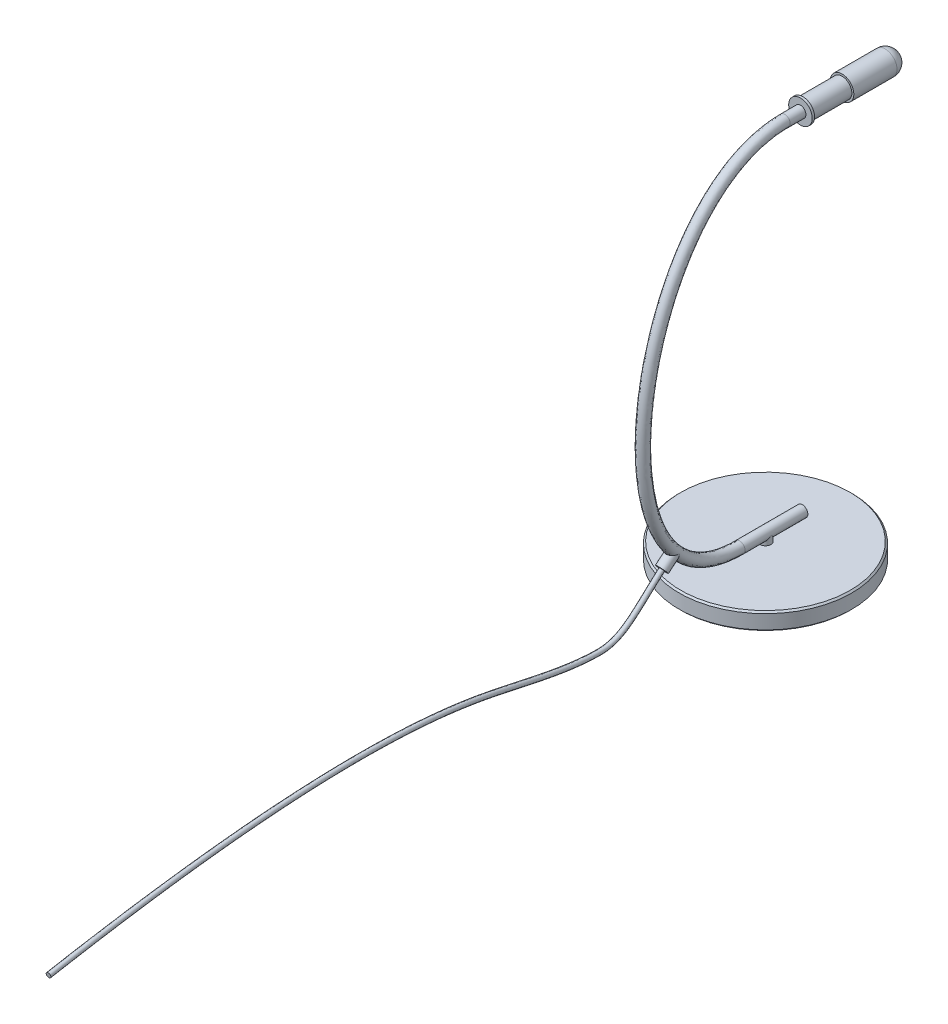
ISO-10303-21;
HEADER;
FILE_DESCRIPTION(('STEP AP214'),'2;1');
FILE_NAME('part.step','',(''),(''),'','','');
FILE_SCHEMA(('AUTOMOTIVE_DESIGN { 1 0 10303 214 1 1 1 1 }'));
ENDSEC;
DATA;
#1=APPLICATION_CONTEXT('core data for automotive mechanical design processes');
#2=APPLICATION_PROTOCOL_DEFINITION('international standard','automotive_design',2000,#1);
#3=PRODUCT_CONTEXT('',#1,'mechanical');
#4=PRODUCT('Part','Part','',(#3));
#5=PRODUCT_RELATED_PRODUCT_CATEGORY('part','',(#4));
#6=PRODUCT_DEFINITION_FORMATION('','',#4);
#7=PRODUCT_DEFINITION_CONTEXT('part definition',#1,'design');
#8=PRODUCT_DEFINITION('design','',#6,#7);
#9=PRODUCT_DEFINITION_SHAPE('','',#8);
#10=(LENGTH_UNIT() NAMED_UNIT(*) SI_UNIT(.MILLI.,.METRE.));
#11=(NAMED_UNIT(*) PLANE_ANGLE_UNIT() SI_UNIT($,.RADIAN.));
#12=(NAMED_UNIT(*) SI_UNIT($,.STERADIAN.) SOLID_ANGLE_UNIT());
#13=UNCERTAINTY_MEASURE_WITH_UNIT(LENGTH_MEASURE(1.E-05),#10,'distance_accuracy_value','');
#14=(GEOMETRIC_REPRESENTATION_CONTEXT(3) GLOBAL_UNCERTAINTY_ASSIGNED_CONTEXT((#13)) GLOBAL_UNIT_ASSIGNED_CONTEXT((#10,
#11,#12)) REPRESENTATION_CONTEXT('',''));
#15=CARTESIAN_POINT('',(0.,0.,0.));
#16=DIRECTION('',(0.,0.,1.));
#17=DIRECTION('',(1.,0.,0.));
#18=AXIS2_PLACEMENT_3D('',#15,#16,#17);
#19=CARTESIAN_POINT('',(0.,441.885890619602,-185.532824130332));
#20=DIRECTION('',(0.,0.,1.));
#21=DIRECTION('',(0.,-1.,0.));
#22=AXIS2_PLACEMENT_3D('',#19,#20,#21);
#23=CYLINDRICAL_SURFACE('',#22,15.);
#24=CARTESIAN_POINT('',(0.,441.885890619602,-170.532824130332));
#25=DIRECTION('',(0.,0.,1.));
#26=DIRECTION('',(0.,-1.,0.));
#27=AXIS2_PLACEMENT_3D('',#24,#25,#26);
#28=CIRCLE('',#27,15.);
#29=CARTESIAN_POINT('',(0.,426.885890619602,-170.532824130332));
#30=VERTEX_POINT('',#29);
#31=EDGE_CURVE('E12',#30,#30,#28,.T.);
#32=ORIENTED_EDGE('',*,*,#31,.T.);
#33=EDGE_LOOP('',(#32));
#34=FACE_BOUND('',#33,.T.);
#35=CARTESIAN_POINT('',(0.,441.885890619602,-115.532824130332));
#36=DIRECTION('',(0.,0.,-1.));
#37=DIRECTION('',(0.,1.,0.));
#38=AXIS2_PLACEMENT_3D('',#35,#36,#37);
#39=CIRCLE('',#38,15.);
#40=CARTESIAN_POINT('',(0.,456.885890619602,-115.532824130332));
#41=VERTEX_POINT('',#40);
#42=EDGE_CURVE('E70',#41,#41,#39,.T.);
#43=ORIENTED_EDGE('',*,*,#42,.T.);
#44=EDGE_LOOP('',(#43));
#45=FACE_BOUND('',#44,.T.);
#46=ADVANCED_FACE('F63',(#34,#45),#23,.T.);
#47=CARTESIAN_POINT('',(0.,441.885890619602,-115.532824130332));
#48=DIRECTION('',(0.,0.,-1.));
#49=DIRECTION('',(0.,1.,0.));
#50=AXIS2_PLACEMENT_3D('',#47,#48,#49);
#51=PLANE('',#50);
#52=ORIENTED_EDGE('',*,*,#42,.F.);
#53=EDGE_LOOP('',(#52));
#54=FACE_BOUND('',#53,.T.);
#55=ADVANCED_FACE('F77',(#54),#51,.F.);
#56=CARTESIAN_POINT('',(0.,441.885890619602,-170.532824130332));
#57=DIRECTION('',(0.,0.,-1.));
#58=DIRECTION('',(0.,1.,0.));
#59=AXIS2_PLACEMENT_3D('',#56,#57,#58);
#60=SPHERICAL_SURFACE('',#59,15.);
#61=ORIENTED_EDGE('',*,*,#31,.F.);
#62=EDGE_LOOP('',(#61));
#63=FACE_BOUND('',#62,.T.);
#64=ADVANCED_FACE('F65',(#63),#60,.T.);
#65=CLOSED_SHELL('',(#46,#55,#64));
#66=MANIFOLD_SOLID_BREP('B2',#65);
#67=CARTESIAN_POINT('',(0.,441.885890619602,-115.532824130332));
#68=DIRECTION('',(0.,0.,1.));
#69=DIRECTION('',(0.,-1.,0.));
#70=AXIS2_PLACEMENT_3D('',#67,#68,#69);
#71=CYLINDRICAL_SURFACE('',#70,12.5);
#72=CARTESIAN_POINT('',(0.,441.885890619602,-115.532824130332));
#73=DIRECTION('',(0.,0.,-1.));
#74=DIRECTION('',(0.,1.,0.));
#75=AXIS2_PLACEMENT_3D('',#72,#73,#74);
#76=CIRCLE('',#75,12.5);
#77=CARTESIAN_POINT('',(0.,454.385890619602,-115.532824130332));
#78=VERTEX_POINT('',#77);
#79=EDGE_CURVE('E62',#78,#78,#76,.T.);
#80=ORIENTED_EDGE('',*,*,#79,.F.);
#81=EDGE_LOOP('',(#80));
#82=FACE_BOUND('',#81,.T.);
#83=CARTESIAN_POINT('',(0.,441.885890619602,-65.5328241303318));
#84=DIRECTION('',(0.,0.,-1.));
#85=DIRECTION('',(0.,1.,0.));
#86=AXIS2_PLACEMENT_3D('',#83,#84,#85);
#87=CIRCLE('',#86,12.5);
#88=CARTESIAN_POINT('',(0.,454.385890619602,-65.5328241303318));
#89=VERTEX_POINT('',#88);
#90=EDGE_CURVE('E114',#89,#89,#87,.T.);
#91=ORIENTED_EDGE('',*,*,#90,.T.);
#92=EDGE_LOOP('',(#91));
#93=FACE_BOUND('',#92,.T.);
#94=ADVANCED_FACE('F111',(#82,#93),#71,.T.);
#95=CARTESIAN_POINT('',(0.,441.885890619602,-115.532824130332));
#96=DIRECTION('',(0.,0.,-1.));
#97=DIRECTION('',(0.,1.,0.));
#98=AXIS2_PLACEMENT_3D('',#95,#96,#97);
#99=PLANE('',#98);
#100=ORIENTED_EDGE('',*,*,#79,.T.);
#101=EDGE_LOOP('',(#100));
#102=FACE_BOUND('',#101,.T.);
#103=ADVANCED_FACE('F126',(#102),#99,.T.);
#104=CARTESIAN_POINT('',(0.,441.885890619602,-65.5328241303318));
#105=DIRECTION('',(0.,0.,-1.));
#106=DIRECTION('',(0.,1.,0.));
#107=AXIS2_PLACEMENT_3D('',#104,#105,#106);
#108=PLANE('',#107);
#109=ORIENTED_EDGE('',*,*,#90,.F.);
#110=EDGE_LOOP('',(#109));
#111=FACE_BOUND('',#110,.T.);
#112=ADVANCED_FACE('F124',(#111),#108,.F.);
#113=CLOSED_SHELL('',(#94,#103,#112));
#114=MANIFOLD_SOLID_BREP('B7',#113);
#115=CARTESIAN_POINT('',(0.,-32.,-18.));
#116=DIRECTION('',(0.,1.,0.));
#117=DIRECTION('',(0.,0.,1.));
#118=AXIS2_PLACEMENT_3D('',#115,#116,#117);
#119=CYLINDRICAL_SURFACE('',#118,110.);
#120=CARTESIAN_POINT('',(0.,-30.,-18.));
#121=DIRECTION('',(0.,-1.,0.));
#122=DIRECTION('',(0.,0.,-1.));
#123=AXIS2_PLACEMENT_3D('',#120,#121,#122);
#124=CIRCLE('',#123,110.);
#125=CARTESIAN_POINT('',(0.,-30.,-128.));
#126=VERTEX_POINT('',#125);
#127=EDGE_CURVE('E167',#126,#126,#124,.F.);
#128=ORIENTED_EDGE('',*,*,#127,.T.);
#129=EDGE_LOOP('',(#128));
#130=FACE_BOUND('',#129,.T.);
#131=CARTESIAN_POINT('',(0.,-11.9999999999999,-18.));
#132=DIRECTION('',(0.,-1.,0.));
#133=DIRECTION('',(0.,0.,-1.));
#134=AXIS2_PLACEMENT_3D('',#131,#132,#133);
#135=CIRCLE('',#134,110.);
#136=CARTESIAN_POINT('',(0.,-11.9999999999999,-128.));
#137=VERTEX_POINT('',#136);
#138=EDGE_CURVE('E171',#137,#137,#135,.T.);
#139=ORIENTED_EDGE('',*,*,#138,.T.);
#140=EDGE_LOOP('',(#139));
#141=FACE_BOUND('',#140,.T.);
#142=ADVANCED_FACE('F160',(#130,#141),#119,.T.);
#143=CARTESIAN_POINT('',(0.,-32.,-18.));
#144=DIRECTION('',(0.,-1.,0.));
#145=DIRECTION('',(0.,0.,-1.));
#146=AXIS2_PLACEMENT_3D('',#143,#144,#145);
#147=PLANE('',#146);
#148=CARTESIAN_POINT('',(0.,-32.,-18.));
#149=DIRECTION('',(0.,-1.,0.));
#150=DIRECTION('',(0.,0.,-1.));
#151=AXIS2_PLACEMENT_3D('',#148,#149,#150);
#152=CIRCLE('',#151,108.);
#153=CARTESIAN_POINT('',(0.,-32.,-126.));
#154=VERTEX_POINT('',#153);
#155=EDGE_CURVE('E175',#154,#154,#152,.T.);
#156=ORIENTED_EDGE('',*,*,#155,.T.);
#157=EDGE_LOOP('',(#156));
#158=FACE_BOUND('',#157,.T.);
#159=ADVANCED_FACE('F181',(#158),#147,.T.);
#160=CARTESIAN_POINT('',(0.,-10.,-18.));
#161=DIRECTION('',(0.,-1.,0.));
#162=DIRECTION('',(0.,0.,-1.));
#163=AXIS2_PLACEMENT_3D('',#160,#161,#162);
#164=PLANE('',#163);
#165=CARTESIAN_POINT('',(0.,-10.,-18.));
#166=DIRECTION('',(0.,-1.,0.));
#167=DIRECTION('',(0.,0.,-1.));
#168=AXIS2_PLACEMENT_3D('',#165,#166,#167);
#169=CIRCLE('',#168,108.);
#170=CARTESIAN_POINT('',(0.,-9.99999999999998,-126.));
#171=VERTEX_POINT('',#170);
#172=EDGE_CURVE('E110',#171,#171,#169,.F.);
#173=ORIENTED_EDGE('',*,*,#172,.T.);
#174=EDGE_LOOP('',(#173));
#175=FACE_BOUND('',#174,.T.);
#176=ADVANCED_FACE('F185',(#175),#164,.F.);
#177=CARTESIAN_POINT('',(0.,-32.,-18.));
#178=DIRECTION('',(0.,1.,0.));
#179=DIRECTION('',(0.,0.,1.));
#180=AXIS2_PLACEMENT_3D('',#177,#178,#179);
#181=CONICAL_SURFACE('',#180,108.,0.785398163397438);
#182=ORIENTED_EDGE('',*,*,#127,.F.);
#183=EDGE_LOOP('',(#182));
#184=FACE_BOUND('',#183,.T.);
#185=ORIENTED_EDGE('',*,*,#155,.F.);
#186=EDGE_LOOP('',(#185));
#187=FACE_BOUND('',#186,.T.);
#188=ADVANCED_FACE('F183',(#184,#187),#181,.T.);
#189=CARTESIAN_POINT('',(0.,-11.9999999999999,-18.));
#190=DIRECTION('',(0.,-1.,0.));
#191=DIRECTION('',(0.,0.,-1.));
#192=AXIS2_PLACEMENT_3D('',#189,#190,#191);
#193=CONICAL_SURFACE('',#192,110.,0.785398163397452);
#194=ORIENTED_EDGE('',*,*,#172,.F.);
#195=EDGE_LOOP('',(#194));
#196=FACE_BOUND('',#195,.T.);
#197=ORIENTED_EDGE('',*,*,#138,.F.);
#198=EDGE_LOOP('',(#197));
#199=FACE_BOUND('',#198,.T.);
#200=ADVANCED_FACE('F162',(#196,#199),#193,.T.);
#201=CLOSED_SHELL('',(#142,#159,#176,#188,#200));
#202=MANIFOLD_SOLID_BREP('B57',#201);
#203=CARTESIAN_POINT('',(0.,25.0621077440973,113.928563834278));
#204=DIRECTION('',(0.,-0.64278760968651,0.766044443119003));
#205=DIRECTION('',(0.,-0.766044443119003,-0.64278760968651));
#206=AXIS2_PLACEMENT_3D('',#203,#204,#205);
#207=PLANE('',#206);
#208=CARTESIAN_POINT('',(0.,25.0621077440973,113.928563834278));
#209=DIRECTION('',(0.,-0.64278760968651,0.766044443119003));
#210=DIRECTION('',(0.,-0.766044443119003,-0.64278760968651));
#211=AXIS2_PLACEMENT_3D('',#208,#209,#210);
#212=CIRCLE('',#211,7.);
#213=CARTESIAN_POINT('',(0.,19.6997966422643,109.429050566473));
#214=VERTEX_POINT('',#213);
#215=EDGE_CURVE('E274',#214,#214,#212,.T.);
#216=ORIENTED_EDGE('',*,*,#215,.T.);
#217=EDGE_LOOP('',(#216));
#218=FACE_BOUND('',#217,.T.);
#219=CARTESIAN_POINT('',(-3.,25.0621077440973,113.928563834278));
#220=CARTESIAN_POINT('',(-3.00000806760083,24.9974323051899,113.874294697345));
#221=CARTESIAN_POINT('',(-2.99643844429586,24.9327597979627,113.820028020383));
#222=CARTESIAN_POINT('',(-2.98220626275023,24.8038773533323,113.711882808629));
#223=CARTESIAN_POINT('',(-2.971544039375,24.7396673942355,113.658004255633));
#224=CARTESIAN_POINT('',(-2.9431989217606,24.6122047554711,113.551050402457));
#225=CARTESIAN_POINT('',(-2.92552089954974,24.5489514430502,113.497974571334));
#226=CARTESIAN_POINT('',(-2.88328734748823,24.4238258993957,113.392981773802));
#227=CARTESIAN_POINT('',(-2.85873190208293,24.3619536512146,113.341064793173));
#228=CARTESIAN_POINT('',(-2.77494799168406,24.1790071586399,113.187554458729));
#229=CARTESIAN_POINT('',(-2.70558998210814,24.0605496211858,113.088156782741));
#230=CARTESIAN_POINT('',(-2.54194131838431,23.8343275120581,112.898333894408));
#231=CARTESIAN_POINT('',(-2.44765562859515,23.7265608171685,112.807906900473));
#232=CARTESIAN_POINT('',(-2.23680431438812,23.5246813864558,112.638509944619));
#233=CARTESIAN_POINT('',(-2.12024156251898,23.4305668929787,112.559538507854));
#234=CARTESIAN_POINT('',(-1.86812285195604,23.258660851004,112.415292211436));
#235=CARTESIAN_POINT('',(-1.73256402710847,23.1808717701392,112.350019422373));
#236=CARTESIAN_POINT('',(-1.44636702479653,23.0438670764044,112.23505883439));
#237=CARTESIAN_POINT('',(-1.29573444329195,22.9846446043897,112.185365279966));
#238=CARTESIAN_POINT('',(-0.983634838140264,22.886423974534,112.10294838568));
#239=CARTESIAN_POINT('',(-0.822168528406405,22.8474244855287,112.070223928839));
#240=CARTESIAN_POINT('',(-0.49302774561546,22.7907607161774,112.022677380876));
#241=CARTESIAN_POINT('',(-0.32535506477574,22.7730903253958,112.007850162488));
#242=CARTESIAN_POINT('',(0.011492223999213,22.7595704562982,111.996505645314));
#243=CARTESIAN_POINT('',(0.180666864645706,22.7637214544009,111.999988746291));
#244=CARTESIAN_POINT('',(0.515656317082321,22.7937123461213,112.025154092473));
#245=CARTESIAN_POINT('',(0.68147166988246,22.819548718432,112.04683338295));
#246=CARTESIAN_POINT('',(1.00516347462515,22.8922174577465,112.107809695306));
#247=CARTESIAN_POINT('',(1.16303995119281,22.9390497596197,112.147106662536));
#248=CARTESIAN_POINT('',(1.39034658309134,23.0239469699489,112.218343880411));
#249=CARTESIAN_POINT('',(1.46456897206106,23.0547084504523,112.244155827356));
#250=CARTESIAN_POINT('',(1.6093719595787,23.1209088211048,112.299704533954));
#251=CARTESIAN_POINT('',(1.67995339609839,23.1563466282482,112.329440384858));
#252=CARTESIAN_POINT('',(1.81693865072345,23.2316360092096,112.392615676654));
#253=CARTESIAN_POINT('',(1.88334418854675,23.2714857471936,112.426053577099));
#254=CARTESIAN_POINT('',(2.01159250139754,23.3553527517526,112.496426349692));
#255=CARTESIAN_POINT('',(2.07343081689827,23.3993739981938,112.533364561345));
#256=CARTESIAN_POINT('',(2.25129466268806,23.5371671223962,112.648986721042));
#257=CARTESIAN_POINT('',(2.35981689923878,23.6367497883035,112.732546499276));
#258=CARTESIAN_POINT('',(2.55346588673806,23.8484668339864,112.910198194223));
#259=CARTESIAN_POINT('',(2.6385934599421,23.9606007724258,113.00428974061));
#260=CARTESIAN_POINT('',(2.746983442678,24.1357816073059,113.151283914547));
#261=CARTESIAN_POINT('',(2.77992457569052,24.1954146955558,113.201322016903));
#262=CARTESIAN_POINT('',(2.83911248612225,24.3165614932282,113.302976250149));
#263=CARTESIAN_POINT('',(2.86536468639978,24.3780736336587,113.354591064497));
#264=CARTESIAN_POINT('',(2.91098523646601,24.5025069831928,113.459003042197));
#265=CARTESIAN_POINT('',(2.93036030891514,24.5654267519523,113.511798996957));
#266=CARTESIAN_POINT('',(2.9621253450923,24.6922809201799,113.61824228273));
#267=CARTESIAN_POINT('',(2.97451735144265,24.7562150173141,113.671889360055));
#268=CARTESIAN_POINT('',(2.98891726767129,24.8605913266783,113.759471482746));
#269=CARTESIAN_POINT('',(2.99307594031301,24.9008666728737,113.793266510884));
#270=CARTESIAN_POINT('',(2.99861529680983,24.981462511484,113.860894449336));
#271=CARTESIAN_POINT('',(3.00000056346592,25.0217828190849,113.894727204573));
#272=CARTESIAN_POINT('',(3.,25.0621077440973,113.928563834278));
#273=B_SPLINE_CURVE_WITH_KNOTS('',3,(#219,#220,#221,#222,#223,#224,#225,#226,#227,#228,#229,
#230,#231,#232,#233,#234,#235,#236,#237,#238,#239,#240,#241,#242,#243,#244,#245,#246,#247,#248,
#249,#250,#251,#252,#253,#254,#255,#256,#257,#258,#259,#260,#261,#262,#263,#264,#265,#266,#267,
#268,#269,#270,#271,#272),.UNSPECIFIED.,.F.,.F.,(4,2,2,2,2,2,2,2,2,2,2,2,2,2,2,2,2,2,2,2,2,2,2,
2,2,2,4),(0.,0.253201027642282,0.506390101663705,0.759403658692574,1.01241410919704,
1.51822494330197,2.02393512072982,2.52958013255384,3.035301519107,3.54083585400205,
4.04633690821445,4.55169311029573,5.05706034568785,5.56234553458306,6.06762915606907,
6.32054926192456,6.57341089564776,6.82616770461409,7.0791681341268,7.58462982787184,
8.09007375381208,8.34340756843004,8.59653534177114,8.8494149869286,9.10222062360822,
9.26037331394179,9.41826445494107),.UNSPECIFIED.);
#274=CARTESIAN_POINT('',(-3.,25.0621077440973,113.928563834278));
#275=VERTEX_POINT('',#274);
#276=CARTESIAN_POINT('',(3.,25.0621077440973,113.928563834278));
#277=VERTEX_POINT('',#276);
#278=EDGE_CURVE('E238',#275,#277,#273,.T.);
#279=ORIENTED_EDGE('',*,*,#278,.F.);
#280=DIRECTION('',(1.,0.,0.));
#281=VECTOR('',#280,1.);
#282=CARTESIAN_POINT('',(0.,25.0621077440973,113.928563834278));
#283=LINE('',#282,#281);
#284=EDGE_CURVE('E158',#275,#277,#283,.T.);
#285=ORIENTED_EDGE('',*,*,#284,.T.);
#286=EDGE_LOOP('',(#279,#285));
#287=FACE_BOUND('',#286,.T.);
#288=ADVANCED_FACE('F230',(#218,#287),#207,.T.);
#289=CARTESIAN_POINT('',(0.,-10.,-18.));
#290=DIRECTION('',(0.,1.,0.));
#291=DIRECTION('',(0.,0.,1.));
#292=AXIS2_PLACEMENT_3D('',#289,#290,#291);
#293=PLANE('',#292);
#294=CARTESIAN_POINT('',(0.,-10.,-18.));
#295=DIRECTION('',(0.,1.,0.));
#296=DIRECTION('',(0.,0.,1.));
#297=AXIS2_PLACEMENT_3D('',#294,#295,#296);
#298=CIRCLE('',#297,7.);
#299=CARTESIAN_POINT('',(0.,-10.,-11.));
#300=VERTEX_POINT('',#299);
#301=EDGE_CURVE('E288',#300,#300,#298,.T.);
#302=ORIENTED_EDGE('',*,*,#301,.F.);
#303=EDGE_LOOP('',(#302));
#304=FACE_BOUND('',#303,.T.);
#305=ADVANCED_FACE('F232',(#304),#293,.F.);
#306=CARTESIAN_POINT('',(0.,7.8,-18.));
#307=DIRECTION('',(0.,-1.,0.));
#308=DIRECTION('',(0.,0.,-1.));
#309=AXIS2_PLACEMENT_3D('',#306,#307,#308);
#310=CYLINDRICAL_SURFACE('',#309,7.);
#311=CARTESIAN_POINT('',(0.,0.,-18.));
#312=DIRECTION('',(0.,-0.707106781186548,-0.707106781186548));
#313=DIRECTION('',(0.,0.707106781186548,-0.707106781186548));
#314=AXIS2_PLACEMENT_3D('',#311,#312,#313);
#315=ELLIPSE('',#314,9.89949493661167,7.);
#316=CARTESIAN_POINT('',(7.,0.,-18.));
#317=VERTEX_POINT('',#316);
#318=CARTESIAN_POINT('',(-7.,0.,-18.));
#319=VERTEX_POINT('',#318);
#320=EDGE_CURVE('E295',#317,#319,#315,.T.);
#321=ORIENTED_EDGE('',*,*,#320,.T.);
#322=CARTESIAN_POINT('',(0.,0.,-18.));
#323=DIRECTION('',(0.,-0.707106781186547,0.707106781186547));
#324=DIRECTION('',(0.,-0.707106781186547,-0.707106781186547));
#325=AXIS2_PLACEMENT_3D('',#322,#323,#324);
#326=ELLIPSE('',#325,9.89949493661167,7.);
#327=EDGE_CURVE('E301',#319,#317,#326,.T.);
#328=ORIENTED_EDGE('',*,*,#327,.T.);
#329=EDGE_LOOP('',(#321,#328));
#330=FACE_BOUND('',#329,.T.);
#331=ORIENTED_EDGE('',*,*,#301,.T.);
#332=EDGE_LOOP('',(#331));
#333=FACE_BOUND('',#332,.T.);
#334=ADVANCED_FACE('F341',(#330,#333),#310,.T.);
#335=CARTESIAN_POINT('',(0.,441.885890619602,-62.5328241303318));
#336=DIRECTION('',(0.,0.,1.));
#337=DIRECTION('',(1.,0.,0.));
#338=AXIS2_PLACEMENT_3D('',#335,#336,#337);
#339=CYLINDRICAL_SURFACE('',#338,7.);
#340=CARTESIAN_POINT('',(0.,441.885890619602,-42.5328241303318));
#341=DIRECTION('',(0.,0.,-1.));
#342=DIRECTION('',(0.,1.,0.));
#343=AXIS2_PLACEMENT_3D('',#340,#341,#342);
#344=CIRCLE('',#343,7.);
#345=CARTESIAN_POINT('',(0.,448.885890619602,-42.5328241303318));
#346=VERTEX_POINT('',#345);
#347=EDGE_CURVE('E294',#346,#346,#344,.T.);
#348=ORIENTED_EDGE('',*,*,#347,.T.);
#349=EDGE_LOOP('',(#348));
#350=FACE_BOUND('',#349,.T.);
#351=CARTESIAN_POINT('',(0.,441.885890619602,-62.5328241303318));
#352=DIRECTION('',(0.,0.,-1.));
#353=DIRECTION('',(0.,1.,0.));
#354=AXIS2_PLACEMENT_3D('',#351,#352,#353);
#355=CIRCLE('',#354,7.);
#356=CARTESIAN_POINT('',(0.,448.885890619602,-62.5328241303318));
#357=VERTEX_POINT('',#356);
#358=EDGE_CURVE('E298',#357,#357,#355,.T.);
#359=ORIENTED_EDGE('',*,*,#358,.F.);
#360=EDGE_LOOP('',(#359));
#361=FACE_BOUND('',#360,.T.);
#362=ADVANCED_FACE('F329',(#350,#361),#339,.T.);
#363=CARTESIAN_POINT('',(0.,448.885890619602,-42.5328241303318));
#364=CARTESIAN_POINT('',(0.,448.885890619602,-42.1384598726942));
#365=CARTESIAN_POINT('',(0.,448.884113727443,-41.7295431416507));
#366=CARTESIAN_POINT('',(0.,448.87701862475,-40.9277382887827));
#367=CARTESIAN_POINT('',(0.,448.871700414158,-40.5273289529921));
#368=CARTESIAN_POINT('',(0.,448.850452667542,-39.3275896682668));
#369=CARTESIAN_POINT('',(0.,448.829229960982,-38.5297484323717));
#370=CARTESIAN_POINT('',(0.,448.744542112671,-36.1422556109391));
#371=CARTESIAN_POINT('',(0.,448.660056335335,-34.5586348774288));
#372=CARTESIAN_POINT('',(0.,448.323772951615,-29.8325079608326));
#373=CARTESIAN_POINT('',(0.,447.989135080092,-26.7147403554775));
#374=CARTESIAN_POINT('',(0.,446.664437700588,-17.4652423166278));
#375=CARTESIAN_POINT('',(0.,445.353420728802,-11.4374752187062));
#376=CARTESIAN_POINT('',(0.,440.228577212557,6.19489944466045));
#377=CARTESIAN_POINT('',(0.,435.223114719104,17.3451096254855));
#378=CARTESIAN_POINT('',(0.,416.227041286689,48.8080021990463));
#379=CARTESIAN_POINT('',(0.,398.285738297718,67.1309231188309));
#380=CARTESIAN_POINT('',(0.,355.647861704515,98.2369185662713));
#381=CARTESIAN_POINT('',(0.,330.932601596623,111.034587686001));
#382=CARTESIAN_POINT('',(0.,278.118095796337,130.812934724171));
#383=CARTESIAN_POINT('',(0.,250.015253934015,137.791033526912));
#384=CARTESIAN_POINT('',(0.,193.76280077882,145.464215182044));
#385=CARTESIAN_POINT('',(0.,165.61357952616,146.161063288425));
#386=CARTESIAN_POINT('',(0.,112.578375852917,140.68093059));
#387=CARTESIAN_POINT('',(0.,87.6819964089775,134.511921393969));
#388=CARTESIAN_POINT('',(0.,55.2987153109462,119.453573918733));
#389=CARTESIAN_POINT('',(0.,45.3319590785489,113.461978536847));
#390=CARTESIAN_POINT('',(0.,27.5455578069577,99.403044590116));
#391=CARTESIAN_POINT('',(0.,19.7269066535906,91.3314290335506));
#392=CARTESIAN_POINT('',(0.,6.81352279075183,73.0538581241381));
#393=CARTESIAN_POINT('',(0.,1.72556609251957,62.8490651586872));
#394=CARTESIAN_POINT('',(0.,-3.45428252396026,46.0204038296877));
#395=CARTESIAN_POINT('',(0.,-4.77340925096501,40.1583415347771));
#396=CARTESIAN_POINT('',(0.,-6.10298828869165,30.997858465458));
#397=CARTESIAN_POINT('',(0.,-6.43808208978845,27.8830982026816));
#398=CARTESIAN_POINT('',(0.,-6.77445919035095,23.1200110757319));
#399=CARTESIAN_POINT('',(0.,-6.85887771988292,21.5171534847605));
#400=CARTESIAN_POINT('',(0.,-6.94345545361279,19.0902045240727));
#401=CARTESIAN_POINT('',(0.,-6.96463983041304,18.2774441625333));
#402=CARTESIAN_POINT('',(0.,-6.9858440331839,17.052645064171));
#403=CARTESIAN_POINT('',(0.,-6.99115004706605,16.6434355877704));
#404=CARTESIAN_POINT('',(0.,-6.99822803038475,15.8231314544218));
#405=CARTESIAN_POINT('',(0.,-7.,15.3994399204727));
#406=CARTESIAN_POINT('',(0.,-7.,15.));
#407=CARTESIAN_POINT('',(14.,448.885890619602,-42.5328241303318));
#408=CARTESIAN_POINT('',(14.,448.885890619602,-42.1384598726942));
#409=CARTESIAN_POINT('',(14.,448.884113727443,-41.7295431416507));
#410=CARTESIAN_POINT('',(14.,448.87701862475,-40.9277382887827));
#411=CARTESIAN_POINT('',(14.,448.871700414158,-40.5273289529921));
#412=CARTESIAN_POINT('',(14.,448.850452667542,-39.3275896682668));
#413=CARTESIAN_POINT('',(14.,448.829229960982,-38.5297484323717));
#414=CARTESIAN_POINT('',(14.,448.744542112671,-36.1422556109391));
#415=CARTESIAN_POINT('',(14.,448.660056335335,-34.5586348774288));
#416=CARTESIAN_POINT('',(14.,448.323772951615,-29.8325079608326));
#417=CARTESIAN_POINT('',(14.,447.989135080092,-26.7147403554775));
#418=CARTESIAN_POINT('',(14.,446.664437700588,-17.4652423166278));
#419=CARTESIAN_POINT('',(14.,445.353420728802,-11.4374752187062));
#420=CARTESIAN_POINT('',(14.,440.228577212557,6.19489944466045));
#421=CARTESIAN_POINT('',(14.,435.223114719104,17.3451096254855));
#422=CARTESIAN_POINT('',(14.,416.227041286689,48.8080021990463));
#423=CARTESIAN_POINT('',(14.,398.285738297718,67.1309231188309));
#424=CARTESIAN_POINT('',(14.,355.647861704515,98.2369185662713));
#425=CARTESIAN_POINT('',(14.,330.932601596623,111.034587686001));
#426=CARTESIAN_POINT('',(14.,278.118095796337,130.812934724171));
#427=CARTESIAN_POINT('',(14.,250.015253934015,137.791033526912));
#428=CARTESIAN_POINT('',(14.,193.76280077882,145.464215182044));
#429=CARTESIAN_POINT('',(14.,165.61357952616,146.161063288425));
#430=CARTESIAN_POINT('',(14.,112.578375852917,140.68093059));
#431=CARTESIAN_POINT('',(14.,87.6819964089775,134.511921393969));
#432=CARTESIAN_POINT('',(14.,55.2987153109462,119.453573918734));
#433=CARTESIAN_POINT('',(14.,45.3319590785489,113.461978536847));
#434=CARTESIAN_POINT('',(14.,27.5455578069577,99.403044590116));
#435=CARTESIAN_POINT('',(14.,19.7269066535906,91.3314290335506));
#436=CARTESIAN_POINT('',(14.,6.81352279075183,73.0538581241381));
#437=CARTESIAN_POINT('',(14.,1.72556609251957,62.8490651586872));
#438=CARTESIAN_POINT('',(14.,-3.45428252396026,46.0204038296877));
#439=CARTESIAN_POINT('',(14.,-4.77340925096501,40.1583415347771));
#440=CARTESIAN_POINT('',(14.,-6.10298828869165,30.997858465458));
#441=CARTESIAN_POINT('',(14.,-6.43808208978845,27.8830982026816));
#442=CARTESIAN_POINT('',(14.,-6.77445919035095,23.1200110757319));
#443=CARTESIAN_POINT('',(14.,-6.85887771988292,21.5171534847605));
#444=CARTESIAN_POINT('',(14.,-6.94345545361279,19.0902045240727));
#445=CARTESIAN_POINT('',(14.,-6.96463983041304,18.2774441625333));
#446=CARTESIAN_POINT('',(14.,-6.9858440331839,17.052645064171));
#447=CARTESIAN_POINT('',(14.,-6.99115004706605,16.6434355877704));
#448=CARTESIAN_POINT('',(14.,-6.99822803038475,15.8231314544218));
#449=CARTESIAN_POINT('',(14.,-7.,15.3994399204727));
#450=CARTESIAN_POINT('',(14.,-7.,15.));
#451=CARTESIAN_POINT('',(14.,434.885890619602,-42.5328241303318));
#452=CARTESIAN_POINT('',(14.,434.885890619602,-42.1590929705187));
#453=CARTESIAN_POINT('',(14.,434.884296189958,-41.8121040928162));
#454=CARTESIAN_POINT('',(14.,434.877932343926,-41.0929372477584));
#455=CARTESIAN_POINT('',(14.,434.8731629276,-40.7338711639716));
#456=CARTESIAN_POINT('',(14.,434.854112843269,-39.6582213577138));
#457=CARTESIAN_POINT('',(14.,434.835090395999,-38.9431860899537));
#458=CARTESIAN_POINT('',(14.,434.759219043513,-36.8042451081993));
#459=CARTESIAN_POINT('',(14.,434.683567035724,-35.3865042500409));
#460=CARTESIAN_POINT('',(14.,434.382670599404,-31.1577055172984));
#461=CARTESIAN_POINT('',(14.,434.083499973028,-28.3710681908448));
#462=CARTESIAN_POINT('',(14.,432.899933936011,-20.1069982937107));
#463=CARTESIAN_POINT('',(14.,431.729658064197,-14.7252492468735));
#464=CARTESIAN_POINT('',(14.,427.145094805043,1.04825423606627));
#465=CARTESIAN_POINT('',(14.,422.656915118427,11.0717357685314));
#466=CARTESIAN_POINT('',(14.,405.404536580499,39.6465743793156));
#467=CARTESIAN_POINT('',(14.,388.823504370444,56.7043489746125));
#468=CARTESIAN_POINT('',(14.,348.607776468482,86.0432923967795));
#469=CARTESIAN_POINT('',(14.,324.991767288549,98.30986662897));
#470=CARTESIAN_POINT('',(14.,274.239267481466,117.316019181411));
#471=CARTESIAN_POINT('',(14.,247.106373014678,124.058176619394));
#472=CARTESIAN_POINT('',(14.,192.887353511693,131.453985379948));
#473=CARTESIAN_POINT('',(14.,165.800838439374,132.105871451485));
#474=CARTESIAN_POINT('',(14.,115.269036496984,126.884415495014));
#475=CARTESIAN_POINT('',(14.,91.8341466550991,121.003101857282));
#476=CARTESIAN_POINT('',(14.,62.0772243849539,107.166021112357));
#477=CARTESIAN_POINT('',(14.,53.0566962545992,101.722483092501));
#478=CARTESIAN_POINT('',(14.,37.1838207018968,89.1760603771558));
#479=CARTESIAN_POINT('',(14.,30.3304793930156,82.0774526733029));
#480=CARTESIAN_POINT('',(14.,19.0782286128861,66.151045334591));
#481=CARTESIAN_POINT('',(14.,14.6725431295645,57.3220833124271));
#482=CARTESIAN_POINT('',(14.,10.1429849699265,42.6061319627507));
#483=CARTESIAN_POINT('',(14.,8.98081885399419,37.4543266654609));
#484=CARTESIAN_POINT('',(14.,7.80213447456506,29.3334718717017));
#485=CARTESIAN_POINT('',(14.,7.50341977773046,26.5610301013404));
#486=CARTESIAN_POINT('',(14.,7.20261705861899,22.3016748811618));
#487=CARTESIAN_POINT('',(14.,7.12689780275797,20.8651118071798));
#488=CARTESIAN_POINT('',(14.,7.05091633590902,18.6848317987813));
#489=CARTESIAN_POINT('',(14.,7.03185555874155,17.9538328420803));
#490=CARTESIAN_POINT('',(14.,7.01276193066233,16.8509449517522));
#491=CARTESIAN_POINT('',(14.,7.00798031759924,16.4822507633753));
#492=CARTESIAN_POINT('',(14.,7.00159935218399,15.7427276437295));
#493=CARTESIAN_POINT('',(14.,7.,15.3793708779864));
#494=CARTESIAN_POINT('',(14.,7.,15.));
#495=CARTESIAN_POINT('',(0.,434.885890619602,-42.5328241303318));
#496=CARTESIAN_POINT('',(0.,434.885890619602,-42.1590929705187));
#497=CARTESIAN_POINT('',(0.,434.884296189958,-41.8121040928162));
#498=CARTESIAN_POINT('',(0.,434.877932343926,-41.0929372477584));
#499=CARTESIAN_POINT('',(0.,434.8731629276,-40.7338711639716));
#500=CARTESIAN_POINT('',(0.,434.854112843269,-39.6582213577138));
#501=CARTESIAN_POINT('',(0.,434.835090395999,-38.9431860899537));
#502=CARTESIAN_POINT('',(0.,434.759219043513,-36.8042451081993));
#503=CARTESIAN_POINT('',(0.,434.683567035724,-35.3865042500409));
#504=CARTESIAN_POINT('',(0.,434.382670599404,-31.1577055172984));
#505=CARTESIAN_POINT('',(0.,434.083499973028,-28.3710681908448));
#506=CARTESIAN_POINT('',(0.,432.899933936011,-20.1069982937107));
#507=CARTESIAN_POINT('',(0.,431.729658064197,-14.7252492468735));
#508=CARTESIAN_POINT('',(0.,427.145094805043,1.04825423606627));
#509=CARTESIAN_POINT('',(0.,422.656915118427,11.0717357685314));
#510=CARTESIAN_POINT('',(0.,405.404536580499,39.6465743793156));
#511=CARTESIAN_POINT('',(0.,388.823504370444,56.7043489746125));
#512=CARTESIAN_POINT('',(0.,348.607776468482,86.0432923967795));
#513=CARTESIAN_POINT('',(0.,324.991767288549,98.30986662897));
#514=CARTESIAN_POINT('',(0.,274.239267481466,117.316019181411));
#515=CARTESIAN_POINT('',(0.,247.106373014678,124.058176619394));
#516=CARTESIAN_POINT('',(0.,192.887353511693,131.453985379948));
#517=CARTESIAN_POINT('',(0.,165.800838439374,132.105871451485));
#518=CARTESIAN_POINT('',(0.,115.269036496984,126.884415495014));
#519=CARTESIAN_POINT('',(0.,91.8341466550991,121.003101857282));
#520=CARTESIAN_POINT('',(0.,62.0772243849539,107.166021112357));
#521=CARTESIAN_POINT('',(0.,53.0566962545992,101.722483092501));
#522=CARTESIAN_POINT('',(0.,37.1838207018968,89.1760603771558));
#523=CARTESIAN_POINT('',(0.,30.3304793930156,82.0774526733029));
#524=CARTESIAN_POINT('',(0.,19.0782286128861,66.151045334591));
#525=CARTESIAN_POINT('',(0.,14.6725431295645,57.3220833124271));
#526=CARTESIAN_POINT('',(0.,10.1429849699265,42.6061319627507));
#527=CARTESIAN_POINT('',(0.,8.98081885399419,37.4543266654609));
#528=CARTESIAN_POINT('',(0.,7.80213447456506,29.3334718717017));
#529=CARTESIAN_POINT('',(0.,7.50341977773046,26.5610301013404));
#530=CARTESIAN_POINT('',(0.,7.20261705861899,22.3016748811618));
#531=CARTESIAN_POINT('',(0.,7.12689780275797,20.8651118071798));
#532=CARTESIAN_POINT('',(0.,7.05091633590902,18.6848317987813));
#533=CARTESIAN_POINT('',(0.,7.03185555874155,17.9538328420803));
#534=CARTESIAN_POINT('',(0.,7.01276193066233,16.8509449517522));
#535=CARTESIAN_POINT('',(0.,7.00798031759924,16.4822507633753));
#536=CARTESIAN_POINT('',(0.,7.00159935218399,15.7427276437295));
#537=CARTESIAN_POINT('',(0.,7.,15.3793708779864));
#538=CARTESIAN_POINT('',(0.,7.,15.));
#539=CARTESIAN_POINT('',(-14.,434.885890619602,-42.5328241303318));
#540=CARTESIAN_POINT('',(-14.,434.885890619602,-42.1590929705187));
#541=CARTESIAN_POINT('',(-14.,434.884296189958,-41.8121040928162));
#542=CARTESIAN_POINT('',(-14.,434.877932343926,-41.0929372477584));
#543=CARTESIAN_POINT('',(-14.,434.8731629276,-40.7338711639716));
#544=CARTESIAN_POINT('',(-14.,434.854112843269,-39.6582213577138));
#545=CARTESIAN_POINT('',(-14.,434.835090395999,-38.9431860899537));
#546=CARTESIAN_POINT('',(-14.,434.759219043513,-36.8042451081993));
#547=CARTESIAN_POINT('',(-14.,434.683567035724,-35.3865042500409));
#548=CARTESIAN_POINT('',(-14.,434.382670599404,-31.1577055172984));
#549=CARTESIAN_POINT('',(-14.,434.083499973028,-28.3710681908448));
#550=CARTESIAN_POINT('',(-14.,432.899933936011,-20.1069982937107));
#551=CARTESIAN_POINT('',(-14.,431.729658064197,-14.7252492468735));
#552=CARTESIAN_POINT('',(-14.,427.145094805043,1.04825423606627));
#553=CARTESIAN_POINT('',(-14.,422.656915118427,11.0717357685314));
#554=CARTESIAN_POINT('',(-14.,405.404536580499,39.6465743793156));
#555=CARTESIAN_POINT('',(-14.,388.823504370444,56.7043489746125));
#556=CARTESIAN_POINT('',(-14.,348.607776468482,86.0432923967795));
#557=CARTESIAN_POINT('',(-14.,324.991767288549,98.30986662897));
#558=CARTESIAN_POINT('',(-14.,274.239267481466,117.316019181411));
#559=CARTESIAN_POINT('',(-14.,247.106373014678,124.058176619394));
#560=CARTESIAN_POINT('',(-14.,192.887353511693,131.453985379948));
#561=CARTESIAN_POINT('',(-14.,165.800838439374,132.105871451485));
#562=CARTESIAN_POINT('',(-14.,115.269036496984,126.884415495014));
#563=CARTESIAN_POINT('',(-14.,91.8341466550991,121.003101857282));
#564=CARTESIAN_POINT('',(-14.,62.0772243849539,107.166021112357));
#565=CARTESIAN_POINT('',(-14.,53.0566962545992,101.722483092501));
#566=CARTESIAN_POINT('',(-14.,37.1838207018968,89.1760603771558));
#567=CARTESIAN_POINT('',(-14.,30.3304793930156,82.0774526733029));
#568=CARTESIAN_POINT('',(-14.,19.0782286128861,66.151045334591));
#569=CARTESIAN_POINT('',(-14.,14.6725431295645,57.3220833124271));
#570=CARTESIAN_POINT('',(-14.,10.1429849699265,42.6061319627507));
#571=CARTESIAN_POINT('',(-14.,8.98081885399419,37.4543266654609));
#572=CARTESIAN_POINT('',(-14.,7.80213447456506,29.3334718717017));
#573=CARTESIAN_POINT('',(-14.,7.50341977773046,26.5610301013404));
#574=CARTESIAN_POINT('',(-14.,7.20261705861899,22.3016748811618));
#575=CARTESIAN_POINT('',(-14.,7.12689780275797,20.8651118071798));
#576=CARTESIAN_POINT('',(-14.,7.05091633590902,18.6848317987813));
#577=CARTESIAN_POINT('',(-14.,7.03185555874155,17.9538328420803));
#578=CARTESIAN_POINT('',(-14.,7.01276193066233,16.8509449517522));
#579=CARTESIAN_POINT('',(-14.,7.00798031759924,16.4822507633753));
#580=CARTESIAN_POINT('',(-14.,7.00159935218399,15.7427276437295));
#581=CARTESIAN_POINT('',(-14.,7.,15.3793708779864));
#582=CARTESIAN_POINT('',(-14.,7.,15.));
#583=CARTESIAN_POINT('',(-14.,448.885890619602,-42.5328241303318));
#584=CARTESIAN_POINT('',(-14.,448.885890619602,-42.1384598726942));
#585=CARTESIAN_POINT('',(-14.,448.884113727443,-41.7295431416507));
#586=CARTESIAN_POINT('',(-14.,448.87701862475,-40.9277382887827));
#587=CARTESIAN_POINT('',(-14.,448.871700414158,-40.5273289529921));
#588=CARTESIAN_POINT('',(-14.,448.850452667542,-39.3275896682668));
#589=CARTESIAN_POINT('',(-14.,448.829229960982,-38.5297484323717));
#590=CARTESIAN_POINT('',(-14.,448.744542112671,-36.1422556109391));
#591=CARTESIAN_POINT('',(-14.,448.660056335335,-34.5586348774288));
#592=CARTESIAN_POINT('',(-14.,448.323772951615,-29.8325079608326));
#593=CARTESIAN_POINT('',(-14.,447.989135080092,-26.7147403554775));
#594=CARTESIAN_POINT('',(-14.,446.664437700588,-17.4652423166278));
#595=CARTESIAN_POINT('',(-14.,445.353420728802,-11.4374752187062));
#596=CARTESIAN_POINT('',(-14.,440.228577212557,6.19489944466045));
#597=CARTESIAN_POINT('',(-14.,435.223114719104,17.3451096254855));
#598=CARTESIAN_POINT('',(-14.,416.227041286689,48.8080021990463));
#599=CARTESIAN_POINT('',(-14.,398.285738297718,67.1309231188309));
#600=CARTESIAN_POINT('',(-14.,355.647861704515,98.2369185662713));
#601=CARTESIAN_POINT('',(-14.,330.932601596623,111.034587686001));
#602=CARTESIAN_POINT('',(-14.,278.118095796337,130.812934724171));
#603=CARTESIAN_POINT('',(-14.,250.015253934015,137.791033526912));
#604=CARTESIAN_POINT('',(-14.,193.76280077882,145.464215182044));
#605=CARTESIAN_POINT('',(-14.,165.61357952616,146.161063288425));
#606=CARTESIAN_POINT('',(-14.,112.578375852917,140.68093059));
#607=CARTESIAN_POINT('',(-14.,87.6819964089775,134.511921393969));
#608=CARTESIAN_POINT('',(-14.,55.2987153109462,119.453573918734));
#609=CARTESIAN_POINT('',(-14.,45.3319590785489,113.461978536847));
#610=CARTESIAN_POINT('',(-14.,27.5455578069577,99.403044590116));
#611=CARTESIAN_POINT('',(-14.,19.7269066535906,91.3314290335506));
#612=CARTESIAN_POINT('',(-14.,6.81352279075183,73.0538581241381));
#613=CARTESIAN_POINT('',(-14.,1.72556609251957,62.8490651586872));
#614=CARTESIAN_POINT('',(-14.,-3.45428252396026,46.0204038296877));
#615=CARTESIAN_POINT('',(-14.,-4.77340925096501,40.1583415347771));
#616=CARTESIAN_POINT('',(-14.,-6.10298828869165,30.997858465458));
#617=CARTESIAN_POINT('',(-14.,-6.43808208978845,27.8830982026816));
#618=CARTESIAN_POINT('',(-14.,-6.77445919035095,23.1200110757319));
#619=CARTESIAN_POINT('',(-14.,-6.85887771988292,21.5171534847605));
#620=CARTESIAN_POINT('',(-14.,-6.94345545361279,19.0902045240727));
#621=CARTESIAN_POINT('',(-14.,-6.96463983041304,18.2774441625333));
#622=CARTESIAN_POINT('',(-14.,-6.9858440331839,17.052645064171));
#623=CARTESIAN_POINT('',(-14.,-6.99115004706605,16.6434355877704));
#624=CARTESIAN_POINT('',(-14.,-6.99822803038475,15.8231314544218));
#625=CARTESIAN_POINT('',(-14.,-7.,15.3994399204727));
#626=CARTESIAN_POINT('',(-14.,-7.,15.));
#627=CARTESIAN_POINT('',(0.,448.885890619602,-42.5328241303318));
#628=CARTESIAN_POINT('',(0.,448.885890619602,-42.1384598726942));
#629=CARTESIAN_POINT('',(0.,448.884113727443,-41.7295431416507));
#630=CARTESIAN_POINT('',(0.,448.87701862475,-40.9277382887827));
#631=CARTESIAN_POINT('',(0.,448.871700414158,-40.5273289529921));
#632=CARTESIAN_POINT('',(0.,448.850452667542,-39.3275896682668));
#633=CARTESIAN_POINT('',(0.,448.829229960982,-38.5297484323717));
#634=CARTESIAN_POINT('',(0.,448.744542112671,-36.1422556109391));
#635=CARTESIAN_POINT('',(0.,448.660056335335,-34.5586348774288));
#636=CARTESIAN_POINT('',(0.,448.323772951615,-29.8325079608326));
#637=CARTESIAN_POINT('',(0.,447.989135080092,-26.7147403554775));
#638=CARTESIAN_POINT('',(0.,446.664437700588,-17.4652423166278));
#639=CARTESIAN_POINT('',(0.,445.353420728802,-11.4374752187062));
#640=CARTESIAN_POINT('',(0.,440.228577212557,6.19489944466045));
#641=CARTESIAN_POINT('',(0.,435.223114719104,17.3451096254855));
#642=CARTESIAN_POINT('',(0.,416.227041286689,48.8080021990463));
#643=CARTESIAN_POINT('',(0.,398.285738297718,67.1309231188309));
#644=CARTESIAN_POINT('',(0.,355.647861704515,98.2369185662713));
#645=CARTESIAN_POINT('',(0.,330.932601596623,111.034587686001));
#646=CARTESIAN_POINT('',(0.,278.118095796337,130.812934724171));
#647=CARTESIAN_POINT('',(0.,250.015253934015,137.791033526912));
#648=CARTESIAN_POINT('',(0.,193.76280077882,145.464215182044));
#649=CARTESIAN_POINT('',(0.,165.61357952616,146.161063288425));
#650=CARTESIAN_POINT('',(0.,112.578375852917,140.68093059));
#651=CARTESIAN_POINT('',(0.,87.6819964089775,134.511921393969));
#652=CARTESIAN_POINT('',(0.,55.2987153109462,119.453573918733));
#653=CARTESIAN_POINT('',(0.,45.3319590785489,113.461978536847));
#654=CARTESIAN_POINT('',(0.,27.5455578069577,99.403044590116));
#655=CARTESIAN_POINT('',(0.,19.7269066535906,91.3314290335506));
#656=CARTESIAN_POINT('',(0.,6.81352279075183,73.0538581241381));
#657=CARTESIAN_POINT('',(0.,1.72556609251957,62.8490651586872));
#658=CARTESIAN_POINT('',(0.,-3.45428252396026,46.0204038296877));
#659=CARTESIAN_POINT('',(0.,-4.77340925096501,40.1583415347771));
#660=CARTESIAN_POINT('',(0.,-6.10298828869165,30.997858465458));
#661=CARTESIAN_POINT('',(0.,-6.43808208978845,27.8830982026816));
#662=CARTESIAN_POINT('',(0.,-6.77445919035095,23.1200110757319));
#663=CARTESIAN_POINT('',(0.,-6.85887771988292,21.5171534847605));
#664=CARTESIAN_POINT('',(0.,-6.94345545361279,19.0902045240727));
#665=CARTESIAN_POINT('',(0.,-6.96463983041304,18.2774441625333));
#666=CARTESIAN_POINT('',(0.,-6.9858440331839,17.052645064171));
#667=CARTESIAN_POINT('',(0.,-6.99115004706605,16.6434355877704));
#668=CARTESIAN_POINT('',(0.,-6.99822803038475,15.8231314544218));
#669=CARTESIAN_POINT('',(0.,-7.,15.3994399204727));
#670=CARTESIAN_POINT('',(0.,-7.,15.));
#671=(BOUNDED_SURFACE() B_SPLINE_SURFACE(3,3,((#363,#364,#365,#366,#367,#368,#369,#370,#371,
#372,#373,#374,#375,#376,#377,#378,#379,#380,#381,#382,#383,#384,#385,#386,#387,#388,#389,#390,
#391,#392,#393,#394,#395,#396,#397,#398,#399,#400,#401,#402,#403,#404,#405,#406),(#407,#408,
#409,#410,#411,#412,#413,#414,#415,#416,#417,#418,#419,#420,#421,#422,#423,#424,#425,#426,#427,
#428,#429,#430,#431,#432,#433,#434,#435,#436,#437,#438,#439,#440,#441,#442,#443,#444,#445,#446,
#447,#448,#449,#450),(#451,#452,#453,#454,#455,#456,#457,#458,#459,#460,#461,#462,#463,#464,
#465,#466,#467,#468,#469,#470,#471,#472,#473,#474,#475,#476,#477,#478,#479,#480,#481,#482,#483,
#484,#485,#486,#487,#488,#489,#490,#491,#492,#493,#494),(#495,#496,#497,#498,#499,#500,#501,
#502,#503,#504,#505,#506,#507,#508,#509,#510,#511,#512,#513,#514,#515,#516,#517,#518,#519,#520,
#521,#522,#523,#524,#525,#526,#527,#528,#529,#530,#531,#532,#533,#534,#535,#536,#537,#538),
(#539,#540,#541,#542,#543,#544,#545,#546,#547,#548,#549,#550,#551,#552,#553,#554,#555,#556,#557,
#558,#559,#560,#561,#562,#563,#564,#565,#566,#567,#568,#569,#570,#571,#572,#573,#574,#575,#576,
#577,#578,#579,#580,#581,#582),(#583,#584,#585,#586,#587,#588,#589,#590,#591,#592,#593,#594,
#595,#596,#597,#598,#599,#600,#601,#602,#603,#604,#605,#606,#607,#608,#609,#610,#611,#612,#613,
#614,#615,#616,#617,#618,#619,#620,#621,#622,#623,#624,#625,#626),(#627,#628,#629,#630,#631,
#632,#633,#634,#635,#636,#637,#638,#639,#640,#641,#642,#643,#644,#645,#646,#647,#648,#649,#650,
#651,#652,#653,#654,#655,#656,#657,#658,#659,#660,#661,#662,#663,#664,#665,#666,#667,#668,#669,
#670)),.UNSPECIFIED.,.T.,.F.,.F.) B_SPLINE_SURFACE_WITH_KNOTS((4,3,4),(4,2,2,2,2,2,2,2,2,2,2,2,
2,2,2,2,2,2,2,2,2,4),(0.,0.5,1.),(0.0309027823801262,0.0326959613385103,0.0344891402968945,
0.0380754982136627,0.0452482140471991,0.059593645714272,0.0882845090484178,0.145666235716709,
0.260429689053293,0.375193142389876,0.489956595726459,0.604720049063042,0.719483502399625,
0.776865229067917,0.834246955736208,0.8916286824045,0.920319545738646,0.934664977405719,
0.941837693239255,0.945424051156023,0.947217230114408,0.949010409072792),
.UNSPECIFIED.) GEOMETRIC_REPRESENTATION_ITEM() RATIONAL_B_SPLINE_SURFACE(((1.,1.,1.,1.,1.,1.,1.,
1.,1.,1.,1.,1.,1.,1.,1.,1.,1.,1.,1.,1.,1.,1.,1.,1.,1.,1.,1.,1.,1.,1.,1.,1.,1.,1.,1.,1.,1.,1.,1.,
1.,1.,1.,1.,1.),(0.333333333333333,0.333333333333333,0.333333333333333,0.333333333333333,
0.333333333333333,0.333333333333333,0.333333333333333,0.333333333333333,0.333333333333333,
0.333333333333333,0.333333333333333,0.333333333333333,0.333333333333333,0.333333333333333,
0.333333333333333,0.333333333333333,0.333333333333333,0.333333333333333,0.333333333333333,
0.333333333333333,0.333333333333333,0.333333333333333,0.333333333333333,0.333333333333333,
0.333333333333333,0.333333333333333,0.333333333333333,0.333333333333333,0.333333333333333,
0.333333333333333,0.333333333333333,0.333333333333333,0.333333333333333,0.333333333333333,
0.333333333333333,0.333333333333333,0.333333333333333,0.333333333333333,0.333333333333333,
0.333333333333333,0.333333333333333,0.333333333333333,0.333333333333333,0.333333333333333),
(0.333333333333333,0.333333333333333,0.333333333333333,0.333333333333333,0.333333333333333,
0.333333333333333,0.333333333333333,0.333333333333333,0.333333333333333,0.333333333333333,
0.333333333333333,0.333333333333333,0.333333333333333,0.333333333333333,0.333333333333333,
0.333333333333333,0.333333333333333,0.333333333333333,0.333333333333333,0.333333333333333,
0.333333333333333,0.333333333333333,0.333333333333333,0.333333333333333,0.333333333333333,
0.333333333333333,0.333333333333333,0.333333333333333,0.333333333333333,0.333333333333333,
0.333333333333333,0.333333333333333,0.333333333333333,0.333333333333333,0.333333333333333,
0.333333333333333,0.333333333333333,0.333333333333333,0.333333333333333,0.333333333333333,
0.333333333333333,0.333333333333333,0.333333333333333,0.333333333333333),(1.,1.,1.,1.,1.,1.,1.,
1.,1.,1.,1.,1.,1.,1.,1.,1.,1.,1.,1.,1.,1.,1.,1.,1.,1.,1.,1.,1.,1.,1.,1.,1.,1.,1.,1.,1.,1.,1.,1.,
1.,1.,1.,1.,1.),(0.333333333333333,0.333333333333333,0.333333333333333,0.333333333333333,
0.333333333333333,0.333333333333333,0.333333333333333,0.333333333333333,0.333333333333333,
0.333333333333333,0.333333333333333,0.333333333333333,0.333333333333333,0.333333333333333,
0.333333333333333,0.333333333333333,0.333333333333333,0.333333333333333,0.333333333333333,
0.333333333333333,0.333333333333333,0.333333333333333,0.333333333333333,0.333333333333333,
0.333333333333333,0.333333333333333,0.333333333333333,0.333333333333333,0.333333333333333,
0.333333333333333,0.333333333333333,0.333333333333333,0.333333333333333,0.333333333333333,
0.333333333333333,0.333333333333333,0.333333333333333,0.333333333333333,0.333333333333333,
0.333333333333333,0.333333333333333,0.333333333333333,0.333333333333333,0.333333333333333),
(0.333333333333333,0.333333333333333,0.333333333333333,0.333333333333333,0.333333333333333,
0.333333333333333,0.333333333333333,0.333333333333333,0.333333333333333,0.333333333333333,
0.333333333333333,0.333333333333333,0.333333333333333,0.333333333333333,0.333333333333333,
0.333333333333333,0.333333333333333,0.333333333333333,0.333333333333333,0.333333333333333,
0.333333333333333,0.333333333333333,0.333333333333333,0.333333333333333,0.333333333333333,
0.333333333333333,0.333333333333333,0.333333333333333,0.333333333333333,0.333333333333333,
0.333333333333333,0.333333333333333,0.333333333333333,0.333333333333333,0.333333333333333,
0.333333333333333,0.333333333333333,0.333333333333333,0.333333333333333,0.333333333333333,
0.333333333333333,0.333333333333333,0.333333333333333,0.333333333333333),(1.,1.,1.,1.,1.,1.,1.,
1.,1.,1.,1.,1.,1.,1.,1.,1.,1.,1.,1.,1.,1.,1.,1.,1.,1.,1.,1.,1.,1.,1.,1.,1.,1.,1.,1.,1.,1.,1.,1.,
1.,1.,1.,1.,1.))) REPRESENTATION_ITEM('') SURFACE());
#672=CARTESIAN_POINT('',(7.,37.9178565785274,98.6076789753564));
#673=CARTESIAN_POINT('',(6.99999999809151,37.9183394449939,98.6132357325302));
#674=CARTESIAN_POINT('',(6.99999666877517,37.9188224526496,98.618792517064));
#675=CARTESIAN_POINT('',(6.99954262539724,37.9517730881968,98.9977658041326));
#676=CARTESIAN_POINT('',(6.98406557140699,37.9848760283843,99.37128438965));
#677=CARTESIAN_POINT('',(6.92253024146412,38.0520925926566,100.115934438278));
#678=CARTESIAN_POINT('',(6.87644804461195,38.0862069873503,100.487063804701));
#679=CARTESIAN_POINT('',(6.75268499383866,38.1551941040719,101.224766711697));
#680=CARTESIAN_POINT('',(6.67494148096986,38.1900681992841,101.591329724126));
#681=CARTESIAN_POINT('',(6.48663907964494,38.2601083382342,102.315785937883));
#682=CARTESIAN_POINT('',(6.37609912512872,38.2952742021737,102.673684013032));
#683=CARTESIAN_POINT('',(6.1597386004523,38.3546784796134,103.269376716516));
#684=CARTESIAN_POINT('',(6.06281852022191,38.3789688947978,103.510420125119));
#685=CARTESIAN_POINT('',(5.85180503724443,38.4272524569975,103.984937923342));
#686=CARTESIAN_POINT('',(5.73771207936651,38.4512456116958,104.218412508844));
#687=CARTESIAN_POINT('',(5.49195145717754,38.4986394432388,104.675448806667));
#688=CARTESIAN_POINT('',(5.36031917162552,38.5220412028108,104.899029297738));
#689=CARTESIAN_POINT('',(5.07876576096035,38.5679949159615,105.334437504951));
#690=CARTESIAN_POINT('',(4.92884283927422,38.5905467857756,105.546264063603));
#691=CARTESIAN_POINT('',(4.52774368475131,38.6457901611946,106.061224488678));
#692=CARTESIAN_POINT('',(4.26420616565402,38.6777171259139,106.355150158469));
#693=CARTESIAN_POINT('',(3.83652951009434,38.7222959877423,106.761743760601));
#694=CARTESIAN_POINT('',(3.68859007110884,38.736602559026,106.891549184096));
#695=CARTESIAN_POINT('',(3.38202172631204,38.7638918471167,107.138097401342));
#696=CARTESIAN_POINT('',(3.22339494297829,38.776874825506,107.254842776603));
#697=CARTESIAN_POINT('',(2.92735712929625,38.7989244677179,107.452390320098));
#698=CARTESIAN_POINT('',(2.79169783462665,38.8082650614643,107.535794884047));
#699=CARTESIAN_POINT('',(2.51420325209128,38.8257735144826,107.691728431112));
#700=CARTESIAN_POINT('',(2.37236930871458,38.8339416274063,107.764259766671));
#701=CARTESIAN_POINT('',(2.08318682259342,38.8489656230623,107.897383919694));
#702=CARTESIAN_POINT('',(1.93584038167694,38.8558219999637,107.957981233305));
#703=CARTESIAN_POINT('',(1.63640592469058,38.868096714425,108.066284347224));
#704=CARTESIAN_POINT('',(1.48431785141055,38.8735150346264,108.11398999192));
#705=CARTESIAN_POINT('',(1.17548199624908,38.8828290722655,108.195898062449));
#706=CARTESIAN_POINT('',(1.01871125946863,38.8867151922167,108.230015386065));
#707=CARTESIAN_POINT('',(0.702649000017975,38.8928284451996,108.283648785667));
#708=CARTESIAN_POINT('',(0.543357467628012,38.8950555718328,108.30316480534));
#709=CARTESIAN_POINT('',(0.223672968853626,38.8977971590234,108.327185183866));
#710=CARTESIAN_POINT('',(0.0632803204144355,38.8983120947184,108.331693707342));
#711=CARTESIAN_POINT('',(-0.257206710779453,38.8976178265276,108.325612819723));
#712=CARTESIAN_POINT('',(-0.417301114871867,38.8964087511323,108.315024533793));
#713=CARTESIAN_POINT('',(-0.719934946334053,38.892501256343,108.280774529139));
#714=CARTESIAN_POINT('',(-0.86263782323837,38.889962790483,108.258516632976));
#715=CARTESIAN_POINT('',(-1.14573712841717,38.8835597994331,108.202307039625));
#716=CARTESIAN_POINT('',(-1.28613277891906,38.879694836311,108.168351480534));
#717=CARTESIAN_POINT('',(-1.56364809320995,38.8707105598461,108.089295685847));
#718=CARTESIAN_POINT('',(-1.70076883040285,38.8655916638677,108.044199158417));
#719=CARTESIAN_POINT('',(-1.97109000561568,38.8541833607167,107.943497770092));
#720=CARTESIAN_POINT('',(-2.10428894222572,38.8478935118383,107.887888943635));
#721=CARTESIAN_POINT('',(-2.37161441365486,38.8339541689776,107.764365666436));
#722=CARTESIAN_POINT('',(-2.50554503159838,38.8262586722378,107.696032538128));
#723=CARTESIAN_POINT('',(-2.76793631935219,38.8098183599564,107.549643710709));
#724=CARTESIAN_POINT('',(-2.8963948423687,38.8010731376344,107.471584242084));
#725=CARTESIAN_POINT('',(-3.27296044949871,38.7734358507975,107.224122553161));
#726=CARTESIAN_POINT('',(-3.51235483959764,38.7531369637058,107.041391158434));
#727=CARTESIAN_POINT('',(-3.90985573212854,38.715072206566,106.696066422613));
#728=CARTESIAN_POINT('',(-4.07346714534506,38.6979125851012,106.539586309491));
#729=CARTESIAN_POINT('',(-4.38628311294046,38.6623168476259,106.212925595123));
#730=CARTESIAN_POINT('',(-4.53548607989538,38.6438805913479,106.042743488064));
#731=CARTESIAN_POINT('',(-4.81983609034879,38.6059910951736,105.690576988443));
#732=CARTESIAN_POINT('',(-4.95495229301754,38.5865357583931,105.508568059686));
#733=CARTESIAN_POINT('',(-5.21106386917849,38.5468982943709,105.134996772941));
#734=CARTESIAN_POINT('',(-5.33205926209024,38.5267161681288,104.943434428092));
#735=CARTESIAN_POINT('',(-5.60178668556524,38.4784127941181,104.481324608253));
#736=CARTESIAN_POINT('',(-5.74463514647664,38.4500699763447,104.207356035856));
#737=CARTESIAN_POINT('',(-6.00588870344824,38.3928753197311,103.64802557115));
#738=CARTESIAN_POINT('',(-6.12428388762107,38.3640232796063,103.362659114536));
#739=CARTESIAN_POINT('',(-6.33763575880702,38.3061654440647,102.783259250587));
#740=CARTESIAN_POINT('',(-6.43258626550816,38.2771596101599,102.489223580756));
#741=CARTESIAN_POINT('',(-6.59988599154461,38.2192976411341,101.894916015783));
#742=CARTESIAN_POINT('',(-6.67224102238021,38.1904414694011,101.594645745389));
#743=CARTESIAN_POINT('',(-6.82287171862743,38.1201764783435,100.853283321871));
#744=CARTESIAN_POINT('',(-6.88912414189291,38.0789704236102,100.40970400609));
#745=CARTESIAN_POINT('',(-6.97737663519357,37.9979746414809,99.5187995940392));
#746=CARTESIAN_POINT('',(-6.99945439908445,37.9581825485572,99.0714824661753));
#747=CARTESIAN_POINT('',(-6.99999666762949,37.9188224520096,98.6187925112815));
#748=CARTESIAN_POINT('',(-6.99999999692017,37.9183394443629,98.613235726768));
#749=CARTESIAN_POINT('',(-7.,37.9178565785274,98.6076789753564));
#750=B_SPLINE_CURVE_WITH_KNOTS('',3,(#672,#673,#674,#675,#676,#677,#678,#679,#680,#681,#682,
#683,#684,#685,#686,#687,#688,#689,#690,#691,#692,#693,#694,#695,#696,#697,#698,#699,#700,#701,
#702,#703,#704,#705,#706,#707,#708,#709,#710,#711,#712,#713,#714,#715,#716,#717,#718,#719,#720,
#721,#722,#723,#724,#725,#726,#727,#728,#729,#730,#731,#732,#733,#734,#735,#736,#737,#738,#739,
#740,#741,#742,#743,#744,#745,#746,#747,#748,#749),.UNSPECIFIED.,.F.,.F.,(4,2,2,2,2,2,2,2,2,2,2,
2,2,2,2,2,2,2,2,2,2,2,2,2,2,2,2,2,2,2,2,2,2,2,2,2,2,2,4),(0.,0.0167332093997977,
1.14120198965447,2.26655068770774,3.39413740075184,4.52107440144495,5.30327430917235,
6.08545395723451,6.86607909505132,7.64678097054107,8.82985030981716,9.4212804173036,
10.0125934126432,10.4907095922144,10.9687221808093,11.4465543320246,11.9243922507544,
12.4051774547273,12.8859645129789,13.3666181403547,13.8472359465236,14.2800896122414,
14.7130863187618,15.1459391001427,15.5789554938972,16.0301549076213,16.4815297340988,
17.3839593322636,18.0642746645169,18.7446648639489,19.4265147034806,20.1083636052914,
21.0378203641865,21.9676531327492,22.8977307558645,23.8275689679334,25.1763936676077,
26.5228439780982,26.5395771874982),.UNSPECIFIED.);
#751=CARTESIAN_POINT('',(-7.,37.9178565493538,98.6076790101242));
#752=VERTEX_POINT('',#751);
#753=CARTESIAN_POINT('',(7.,37.9178565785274,98.6076789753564));
#754=VERTEX_POINT('',#753);
#755=EDGE_CURVE('E305',#752,#754,#750,.F.);
#756=CARTESIAN_POINT('',(7.,37.9178565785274,98.6076789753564));
#757=CARTESIAN_POINT('',(6.9999999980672,37.9122998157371,98.6081617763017));
#758=CARTESIAN_POINT('',(6.99999666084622,37.9067430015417,98.6086444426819));
#759=CARTESIAN_POINT('',(6.99954271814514,37.5287465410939,98.6414678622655));
#760=CARTESIAN_POINT('',(6.98410918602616,37.1560974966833,98.6732025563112));
#761=CARTESIAN_POINT('',(6.92274928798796,36.4129685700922,98.7352546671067));
#762=CARTESIAN_POINT('',(6.87679909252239,36.0424906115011,98.7655709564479));
#763=CARTESIAN_POINT('',(6.75339021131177,35.3058754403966,98.8246481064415));
#764=CARTESIAN_POINT('',(6.67586904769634,34.9397483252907,98.8534057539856));
#765=CARTESIAN_POINT('',(6.48810410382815,34.2159545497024,98.9091058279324));
#766=CARTESIAN_POINT('',(6.37787915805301,33.8582831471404,98.9360492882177));
#767=CARTESIAN_POINT('',(6.16202497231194,33.2625016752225,98.9800204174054));
#768=CARTESIAN_POINT('',(6.06524975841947,33.0212009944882,98.9975657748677));
#769=CARTESIAN_POINT('',(5.85453409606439,32.5461013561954,99.031622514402));
#770=CARTESIAN_POINT('',(5.74059409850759,32.3123022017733,99.0481339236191));
#771=CARTESIAN_POINT('',(5.49515061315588,31.8545643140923,99.0800095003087));
#772=CARTESIAN_POINT('',(5.36368253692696,31.6306068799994,99.0953758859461));
#773=CARTESIAN_POINT('',(5.08247374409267,31.1944038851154,99.124900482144));
#774=CARTESIAN_POINT('',(4.93273107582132,30.9821595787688,99.1390585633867));
#775=CARTESIAN_POINT('',(4.53177776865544,30.4656791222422,99.1730627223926));
#776=CARTESIAN_POINT('',(4.26816064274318,30.17068032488,99.1920605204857));
#777=CARTESIAN_POINT('',(3.84034755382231,29.7625733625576,99.2178953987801));
#778=CARTESIAN_POINT('',(3.69235927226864,29.6322792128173,99.2260628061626));
#779=CARTESIAN_POINT('',(3.38569391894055,29.3847942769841,99.2414507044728));
#780=CARTESIAN_POINT('',(3.22701895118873,29.2676009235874,99.2486713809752));
#781=CARTESIAN_POINT('',(2.93071405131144,29.0691623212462,99.2608099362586));
#782=CARTESIAN_POINT('',(2.79482531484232,28.9853201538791,99.2659045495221));
#783=CARTESIAN_POINT('',(2.51686258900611,28.8285778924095,99.2753795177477));
#784=CARTESIAN_POINT('',(2.37478993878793,28.7556754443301,99.2797600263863));
#785=CARTESIAN_POINT('',(2.08512508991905,28.6218811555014,99.2877641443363));
#786=CARTESIAN_POINT('',(1.93753497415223,28.5609848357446,99.2913880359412));
#787=CARTESIAN_POINT('',(1.63761262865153,28.4521599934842,99.2978415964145));
#788=CARTESIAN_POINT('',(1.48528034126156,28.4042316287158,99.3006712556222));
#789=CARTESIAN_POINT('',(1.17596621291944,28.321958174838,99.3055165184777));
#790=CARTESIAN_POINT('',(1.0189616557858,28.2876978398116,99.3075270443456));
#791=CARTESIAN_POINT('',(0.702435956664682,28.2338573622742,99.3106820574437));
#792=CARTESIAN_POINT('',(0.542914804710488,28.2142772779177,99.3118265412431));
#793=CARTESIAN_POINT('',(0.222774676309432,28.1902076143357,99.3132329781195));
#794=CARTESIAN_POINT('',(0.0621560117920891,28.1857139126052,99.3134951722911));
#795=CARTESIAN_POINT('',(-0.25877964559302,28.1919027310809,99.3131337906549));
#796=CARTESIAN_POINT('',(-0.41909665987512,28.2025841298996,99.3125102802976));
#797=CARTESIAN_POINT('',(-0.722273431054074,28.2370983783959,99.3104916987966));
#798=CARTESIAN_POINT('',(-0.865295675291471,28.2595304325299,99.3091787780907));
#799=CARTESIAN_POINT('',(-1.1490269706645,28.3161694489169,99.3058554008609));
#800=CARTESIAN_POINT('',(-1.28973524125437,28.3503803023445,99.3038447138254));
#801=CARTESIAN_POINT('',(-1.56786576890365,28.4300242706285,99.2991481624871));
#802=CARTESIAN_POINT('',(-1.7052891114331,28.4754536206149,99.296462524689));
#803=CARTESIAN_POINT('',(-1.97620299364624,28.5768940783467,99.2904411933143));
#804=CARTESIAN_POINT('',(-2.10969202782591,28.6329091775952,99.2871052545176));
#805=CARTESIAN_POINT('',(-2.37756149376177,28.7573165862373,99.2796608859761));
#806=CARTESIAN_POINT('',(-2.51174649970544,28.8261279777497,99.2755260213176));
#807=CARTESIAN_POINT('',(-2.77462823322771,28.9735356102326,99.2666183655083));
#808=CARTESIAN_POINT('',(-2.90332280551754,29.0521356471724,99.2618453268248));
#809=CARTESIAN_POINT('',(-3.28056390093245,29.3013021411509,99.2466198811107));
#810=CARTESIAN_POINT('',(-3.52036578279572,29.4852814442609,99.2352583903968));
#811=CARTESIAN_POINT('',(-3.91808297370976,29.8325804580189,99.2134893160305));
#812=CARTESIAN_POINT('',(-4.08156146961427,29.989716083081,99.2035434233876));
#813=CARTESIAN_POINT('',(-4.39410982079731,30.317690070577,99.1825406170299));
#814=CARTESIAN_POINT('',(-4.54317813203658,30.4885298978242,99.1714835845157));
#815=CARTESIAN_POINT('',(-4.82725006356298,30.8420018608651,99.1483253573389));
#816=CARTESIAN_POINT('',(-4.96222296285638,31.0246584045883,99.1362219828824));
#817=CARTESIAN_POINT('',(-5.21803685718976,31.3995025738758,99.1110690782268));
#818=CARTESIAN_POINT('',(-5.3388778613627,31.5916901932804,99.0980195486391));
#819=CARTESIAN_POINT('',(-5.6080224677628,32.0548907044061,99.0661619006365));
#820=CARTESIAN_POINT('',(-5.75046931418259,32.3292907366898,99.0469769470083));
#821=CARTESIAN_POINT('',(-6.0109515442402,32.8893660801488,99.0071146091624));
#822=CARTESIAN_POINT('',(-6.12897706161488,33.1750458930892,98.9864366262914));
#823=CARTESIAN_POINT('',(-6.34161672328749,33.7549388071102,98.9437097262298));
#824=CARTESIAN_POINT('',(-6.43622481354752,34.0491540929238,98.9216604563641));
#825=CARTESIAN_POINT('',(-6.60286549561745,34.6436770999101,98.8763140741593));
#826=CARTESIAN_POINT('',(-6.67490391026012,34.943983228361,98.8530172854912));
#827=CARTESIAN_POINT('',(-6.82443400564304,35.6834929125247,98.7946452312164));
#828=CARTESIAN_POINT('',(-6.89009824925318,36.1250623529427,98.7589401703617));
#829=CARTESIAN_POINT('',(-6.97757090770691,37.0115998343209,98.6854837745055));
#830=CARTESIAN_POINT('',(-6.99945612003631,37.4565605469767,98.6477361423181));
#831=CARTESIAN_POINT('',(-6.99999665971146,37.9067430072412,98.6086444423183));
#832=CARTESIAN_POINT('',(-6.99999999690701,37.9122998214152,98.6081617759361));
#833=CARTESIAN_POINT('',(-7.,37.9178565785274,98.6076789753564));
#834=B_SPLINE_CURVE_WITH_KNOTS('',3,(#756,#757,#758,#759,#760,#761,#762,#763,#764,#765,#766,
#767,#768,#769,#770,#771,#772,#773,#774,#775,#776,#777,#778,#779,#780,#781,#782,#783,#784,#785,
#786,#787,#788,#789,#790,#791,#792,#793,#794,#795,#796,#797,#798,#799,#800,#801,#802,#803,#804,
#805,#806,#807,#808,#809,#810,#811,#812,#813,#814,#815,#816,#817,#818,#819,#820,#821,#822,#823,
#824,#825,#826,#827,#828,#829,#830,#831,#832,#833),.UNSPECIFIED.,.F.,.F.,(4,2,2,2,2,2,2,2,2,2,2,
2,2,2,2,2,2,2,2,2,2,2,2,2,2,2,2,2,2,2,2,2,2,2,2,2,2,2,4),(0.,0.0167332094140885,
1.13824947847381,2.26064253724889,3.38526765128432,4.50924633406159,5.29037490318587,
6.0714829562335,6.85103621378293,7.63067279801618,8.81378829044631,9.40524530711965,
9.99658621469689,10.4753980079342,10.9541066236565,11.4326363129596,11.911171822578,
12.3926302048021,12.8740904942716,13.355419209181,13.836712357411,14.2705431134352,
14.704517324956,15.1383460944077,15.5723387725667,16.0244490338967,16.4767351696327,
17.3809850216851,18.061080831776,18.7412494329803,19.4228708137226,20.1044917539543,
21.0324357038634,21.9607538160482,22.8893116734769,23.817629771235,25.158871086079,
26.4977575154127,26.5144907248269),.UNSPECIFIED.);
#835=EDGE_CURVE('E249',#754,#752,#834,.T.);
#836=CARTESIAN_POINT('',(0.,0.,15.));
#837=DIRECTION('',(0.,0.,1.));
#838=DIRECTION('',(0.,-1.,0.));
#839=AXIS2_PLACEMENT_3D('',#836,#837,#838);
#840=CIRCLE('',#839,7.);
#841=CARTESIAN_POINT('',(0.,-7.,15.));
#842=VERTEX_POINT('',#841);
#843=EDGE_CURVE('E291',#842,#842,#840,.T.);
#844=ORIENTED_EDGE('',*,*,#755,.T.);
#845=ORIENTED_EDGE('',*,*,#835,.T.);
#846=EDGE_LOOP('',(#844,#845));
#847=FACE_BOUND('',#846,.T.);
#848=ORIENTED_EDGE('',*,*,#843,.T.);
#849=EDGE_LOOP('',(#848));
#850=FACE_BOUND('',#849,.T.);
#851=ORIENTED_EDGE('',*,*,#347,.F.);
#852=EDGE_LOOP('',(#851));
#853=FACE_BOUND('',#852,.T.);
#854=ADVANCED_FACE('F321',(#847,#850,#853),#671,.F.);
#855=CARTESIAN_POINT('',(0.,0.,0.));
#856=DIRECTION('',(0.,0.,-1.));
#857=DIRECTION('',(-1.,0.,0.));
#858=AXIS2_PLACEMENT_3D('',#855,#856,#857);
#859=CYLINDRICAL_SURFACE('',#858,7.);
#860=ORIENTED_EDGE('',*,*,#320,.F.);
#861=ORIENTED_EDGE('',*,*,#327,.F.);
#862=EDGE_LOOP('',(#860,#861));
#863=FACE_BOUND('',#862,.T.);
#864=ORIENTED_EDGE('',*,*,#843,.F.);
#865=EDGE_LOOP('',(#864));
#866=FACE_BOUND('',#865,.T.);
#867=CARTESIAN_POINT('',(0.,0.,-65.));
#868=DIRECTION('',(0.,0.,1.));
#869=DIRECTION('',(1.,0.,0.));
#870=AXIS2_PLACEMENT_3D('',#867,#868,#869);
#871=CIRCLE('',#870,7.);
#872=CARTESIAN_POINT('',(7.,0.,-65.));
#873=VERTEX_POINT('',#872);
#874=EDGE_CURVE('E277',#873,#873,#871,.T.);
#875=ORIENTED_EDGE('',*,*,#874,.T.);
#876=EDGE_LOOP('',(#875));
#877=FACE_BOUND('',#876,.T.);
#878=ADVANCED_FACE('F328',(#863,#866,#877),#859,.T.);
#879=CARTESIAN_POINT('',(0.,441.885890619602,-65.5328241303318));
#880=DIRECTION('',(0.,0.,1.));
#881=DIRECTION('',(0.,-1.,0.));
#882=AXIS2_PLACEMENT_3D('',#879,#880,#881);
#883=CYLINDRICAL_SURFACE('',#882,15.);
#884=CARTESIAN_POINT('',(0.,441.885890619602,-65.5328241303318));
#885=DIRECTION('',(0.,0.,-1.));
#886=DIRECTION('',(0.,1.,0.));
#887=AXIS2_PLACEMENT_3D('',#884,#885,#886);
#888=CIRCLE('',#887,15.);
#889=CARTESIAN_POINT('',(0.,456.885890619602,-65.5328241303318));
#890=VERTEX_POINT('',#889);
#891=EDGE_CURVE('E285',#890,#890,#888,.T.);
#892=ORIENTED_EDGE('',*,*,#891,.F.);
#893=EDGE_LOOP('',(#892));
#894=FACE_BOUND('',#893,.T.);
#895=CARTESIAN_POINT('',(0.,441.885890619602,-62.5328241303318));
#896=DIRECTION('',(0.,0.,-1.));
#897=DIRECTION('',(0.,1.,0.));
#898=AXIS2_PLACEMENT_3D('',#895,#896,#897);
#899=CIRCLE('',#898,15.);
#900=CARTESIAN_POINT('',(0.,456.885890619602,-62.5328241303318));
#901=VERTEX_POINT('',#900);
#902=EDGE_CURVE('E284',#901,#901,#899,.T.);
#903=ORIENTED_EDGE('',*,*,#902,.T.);
#904=EDGE_LOOP('',(#903));
#905=FACE_BOUND('',#904,.T.);
#906=ADVANCED_FACE('F331',(#894,#905),#883,.T.);
#907=CARTESIAN_POINT('',(0.,441.885890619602,-65.5328241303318));
#908=DIRECTION('',(0.,0.,-1.));
#909=DIRECTION('',(0.,1.,0.));
#910=AXIS2_PLACEMENT_3D('',#907,#908,#909);
#911=PLANE('',#910);
#912=ORIENTED_EDGE('',*,*,#891,.T.);
#913=EDGE_LOOP('',(#912));
#914=FACE_BOUND('',#913,.T.);
#915=ADVANCED_FACE('F395',(#914),#911,.T.);
#916=CARTESIAN_POINT('',(0.,441.885890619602,-62.5328241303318));
#917=DIRECTION('',(0.,0.,-1.));
#918=DIRECTION('',(0.,1.,0.));
#919=AXIS2_PLACEMENT_3D('',#916,#917,#918);
#920=PLANE('',#919);
#921=ORIENTED_EDGE('',*,*,#358,.T.);
#922=EDGE_LOOP('',(#921));
#923=FACE_BOUND('',#922,.T.);
#924=ORIENTED_EDGE('',*,*,#902,.F.);
#925=EDGE_LOOP('',(#924));
#926=FACE_BOUND('',#925,.T.);
#927=ADVANCED_FACE('F389',(#923,#926),#920,.F.);
#928=CARTESIAN_POINT('',(0.,0.,-65.));
#929=DIRECTION('',(0.,0.,1.));
#930=DIRECTION('',(1.,0.,0.));
#931=AXIS2_PLACEMENT_3D('',#928,#929,#930);
#932=PLANE('',#931);
#933=ORIENTED_EDGE('',*,*,#874,.F.);
#934=EDGE_LOOP('',(#933));
#935=FACE_BOUND('',#934,.T.);
#936=ADVANCED_FACE('F358',(#935),#932,.F.);
#937=CARTESIAN_POINT('',(0.,37.9178565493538,98.6076790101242));
#938=DIRECTION('',(0.,-0.64278760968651,0.766044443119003));
#939=DIRECTION('',(0.,-0.766044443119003,-0.64278760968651));
#940=AXIS2_PLACEMENT_3D('',#937,#938,#939);
#941=CYLINDRICAL_SURFACE('',#940,7.);
#942=ORIENTED_EDGE('',*,*,#215,.F.);
#943=EDGE_LOOP('',(#942));
#944=FACE_BOUND('',#943,.T.);
#945=ORIENTED_EDGE('',*,*,#835,.F.);
#946=ORIENTED_EDGE('',*,*,#755,.F.);
#947=EDGE_LOOP('',(#945,#946));
#948=FACE_BOUND('',#947,.T.);
#949=ADVANCED_FACE('F317',(#944,#948),#941,.T.);
#950=CARTESIAN_POINT('',(0.,25.0621077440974,113.928563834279));
#951=DIRECTION('',(0.,-0.662620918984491,0.748954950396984));
#952=DIRECTION('',(0.,-0.748954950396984,-0.662620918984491));
#953=AXIS2_PLACEMENT_3D('',#950,#951,#952);
#954=PLANE('',#953);
#955=ORIENTED_EDGE('',*,*,#284,.F.);
#956=CARTESIAN_POINT('',(0.,25.0621077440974,113.928563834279));
#957=DIRECTION('',(0.,-0.662620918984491,0.748954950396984));
#958=DIRECTION('',(0.,-0.748954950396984,-0.662620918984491));
#959=AXIS2_PLACEMENT_3D('',#956,#957,#958);
#960=CIRCLE('',#959,3.);
#961=EDGE_CURVE('E275',#277,#275,#960,.T.);
#962=ORIENTED_EDGE('',*,*,#961,.F.);
#963=EDGE_LOOP('',(#955,#962));
#964=FACE_BOUND('',#963,.T.);
#965=ADVANCED_FACE('F377',(#964),#954,.F.);
#966=CARTESIAN_POINT('',(0.,-32.,895.169951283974));
#967=DIRECTION('',(0.,-0.179180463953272,0.983816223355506));
#968=DIRECTION('',(0.,-0.983816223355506,-0.179180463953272));
#969=AXIS2_PLACEMENT_3D('',#966,#967,#968);
#970=PLANE('',#969);
#971=CARTESIAN_POINT('',(0.,-32.,895.169951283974));
#972=DIRECTION('',(0.,-0.179180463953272,0.983816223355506));
#973=DIRECTION('',(0.,-0.983816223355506,-0.179180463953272));
#974=AXIS2_PLACEMENT_3D('',#971,#972,#973);
#975=CIRCLE('',#974,3.);
#976=CARTESIAN_POINT('',(0.,-34.9514486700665,894.632409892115));
#977=VERTEX_POINT('',#976);
#978=EDGE_CURVE('E271',#977,#977,#975,.T.);
#979=ORIENTED_EDGE('',*,*,#978,.T.);
#980=EDGE_LOOP('',(#979));
#981=FACE_BOUND('',#980,.T.);
#982=ADVANCED_FACE('F272',(#981),#970,.T.);
#983=CARTESIAN_POINT('',(0.,22.8152428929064,111.940701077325));
#984=CARTESIAN_POINT('',(0.,9.01201332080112,127.542377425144));
#985=CARTESIAN_POINT('',(0.,-2.62728513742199,139.158941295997));
#986=CARTESIAN_POINT('',(0.,-15.8593952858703,155.452470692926));
#987=CARTESIAN_POINT('',(0.,-19.5680269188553,160.703244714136));
#988=CARTESIAN_POINT('',(0.,-25.3115087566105,171.654742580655));
#989=CARTESIAN_POINT('',(0.,-27.3355181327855,177.360181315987));
#990=CARTESIAN_POINT('',(0.,-29.4640689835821,190.376344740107));
#991=CARTESIAN_POINT('',(0.,-29.3820335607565,197.61686233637));
#992=CARTESIAN_POINT('',(0.,-28.758385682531,208.356510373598));
#993=CARTESIAN_POINT('',(0.,-28.4776617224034,211.903633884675));
#994=CARTESIAN_POINT('',(0.,-27.8264587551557,218.963532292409));
#995=CARTESIAN_POINT('',(0.,-27.4496770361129,222.474157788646));
#996=CARTESIAN_POINT('',(0.,-25.3407483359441,239.951355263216));
#997=CARTESIAN_POINT('',(0.,-22.9339654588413,253.689497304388));
#998=CARTESIAN_POINT('',(0.,-14.7329509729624,294.984710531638));
#999=CARTESIAN_POINT('',(0.,-7.96392307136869,322.620670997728));
#1000=CARTESIAN_POINT('',(0.,8.00077721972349,418.191580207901));
#1001=CARTESIAN_POINT('',(0.,10.6139151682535,495.503611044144));
#1002=CARTESIAN_POINT('',(0.,-0.263589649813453,675.522365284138));
#1003=CARTESIAN_POINT('',(0.,-13.7508043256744,778.227209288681));
#1004=CARTESIAN_POINT('',(0.,-34.9514486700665,894.632409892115));
#1005=CARTESIAN_POINT('',(6.,22.8152428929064,111.940701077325));
#1006=CARTESIAN_POINT('',(6.,9.01201332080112,127.542377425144));
#1007=CARTESIAN_POINT('',(6.,-2.62728513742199,139.158941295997));
#1008=CARTESIAN_POINT('',(6.,-15.8593952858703,155.452470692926));
#1009=CARTESIAN_POINT('',(6.,-19.5680269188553,160.703244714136));
#1010=CARTESIAN_POINT('',(6.,-25.3115087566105,171.654742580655));
#1011=CARTESIAN_POINT('',(6.,-27.3355181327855,177.360181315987));
#1012=CARTESIAN_POINT('',(6.,-29.4640689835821,190.376344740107));
#1013=CARTESIAN_POINT('',(6.,-29.3820335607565,197.61686233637));
#1014=CARTESIAN_POINT('',(6.,-28.758385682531,208.356510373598));
#1015=CARTESIAN_POINT('',(6.,-28.4776617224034,211.903633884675));
#1016=CARTESIAN_POINT('',(6.,-27.8264587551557,218.963532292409));
#1017=CARTESIAN_POINT('',(6.,-27.4496770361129,222.474157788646));
#1018=CARTESIAN_POINT('',(6.,-25.3407483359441,239.951355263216));
#1019=CARTESIAN_POINT('',(6.,-22.9339654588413,253.689497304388));
#1020=CARTESIAN_POINT('',(6.,-14.7329509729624,294.984710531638));
#1021=CARTESIAN_POINT('',(6.,-7.96392307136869,322.620670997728));
#1022=CARTESIAN_POINT('',(6.,8.00077721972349,418.191580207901));
#1023=CARTESIAN_POINT('',(6.,10.6139151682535,495.503611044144));
#1024=CARTESIAN_POINT('',(6.,-0.263589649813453,675.522365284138));
#1025=CARTESIAN_POINT('',(6.,-13.7508043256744,778.227209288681));
#1026=CARTESIAN_POINT('',(6.,-34.9514486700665,894.632409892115));
#1027=CARTESIAN_POINT('',(6.,27.3089725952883,115.916426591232));
#1028=CARTESIAN_POINT('',(6.,13.3775587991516,131.662988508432));
#1029=CARTESIAN_POINT('',(6.,1.71745780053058,143.326609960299));
#1030=CARTESIAN_POINT('',(6.,-11.0454015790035,159.042321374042));
#1031=CARTESIAN_POINT('',(6.,-14.5094048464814,163.976121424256));
#1032=CARTESIAN_POINT('',(6.,-19.7429389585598,173.955266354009));
#1033=CARTESIAN_POINT('',(6.,-21.5233106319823,178.995896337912));
#1034=CARTESIAN_POINT('',(6.,-23.4238426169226,190.617716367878));
#1035=CARTESIAN_POINT('',(6.,-23.3807860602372,197.464282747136));
#1036=CARTESIAN_POINT('',(6.,-22.7741455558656,207.911052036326));
#1037=CARTESIAN_POINT('',(6.,-22.4975586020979,211.411792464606));
#1038=CARTESIAN_POINT('',(6.,-21.8572874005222,218.35317612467));
#1039=CARTESIAN_POINT('',(6.,-21.4865588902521,221.807814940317));
#1040=CARTESIAN_POINT('',(6.,-19.4092738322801,239.022773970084));
#1041=CARTESIAN_POINT('',(6.,-17.0313653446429,252.60902896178));
#1042=CARTESIAN_POINT('',(6.,-8.88294416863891,293.63941496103));
#1043=CARTESIAN_POINT('',(6.,-2.09186620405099,321.357064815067));
#1044=CARTESIAN_POINT('',(6.,14.0193818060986,417.805265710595));
#1045=CARTESIAN_POINT('',(6.,16.6224324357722,495.543761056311));
#1046=CARTESIAN_POINT('',(6.,5.70604632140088,676.205986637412));
#1047=CARTESIAN_POINT('',(6.,-7.81681852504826,779.131596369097));
#1048=CARTESIAN_POINT('',(6.,-29.0485513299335,895.707492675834));
#1049=CARTESIAN_POINT('',(0.,27.3089725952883,115.916426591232));
#1050=CARTESIAN_POINT('',(0.,13.3775587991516,131.662988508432));
#1051=CARTESIAN_POINT('',(0.,1.71745780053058,143.326609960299));
#1052=CARTESIAN_POINT('',(0.,-11.0454015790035,159.042321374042));
#1053=CARTESIAN_POINT('',(0.,-14.5094048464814,163.976121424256));
#1054=CARTESIAN_POINT('',(0.,-19.7429389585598,173.955266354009));
#1055=CARTESIAN_POINT('',(0.,-21.5233106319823,178.995896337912));
#1056=CARTESIAN_POINT('',(0.,-23.4238426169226,190.617716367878));
#1057=CARTESIAN_POINT('',(0.,-23.3807860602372,197.464282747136));
#1058=CARTESIAN_POINT('',(0.,-22.7741455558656,207.911052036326));
#1059=CARTESIAN_POINT('',(0.,-22.4975586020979,211.411792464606));
#1060=CARTESIAN_POINT('',(0.,-21.8572874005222,218.35317612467));
#1061=CARTESIAN_POINT('',(0.,-21.4865588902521,221.807814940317));
#1062=CARTESIAN_POINT('',(0.,-19.4092738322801,239.022773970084));
#1063=CARTESIAN_POINT('',(0.,-17.0313653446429,252.60902896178));
#1064=CARTESIAN_POINT('',(0.,-8.88294416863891,293.63941496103));
#1065=CARTESIAN_POINT('',(0.,-2.09186620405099,321.357064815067));
#1066=CARTESIAN_POINT('',(0.,14.0193818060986,417.805265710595));
#1067=CARTESIAN_POINT('',(0.,16.6224324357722,495.543761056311));
#1068=CARTESIAN_POINT('',(0.,5.70604632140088,676.205986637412));
#1069=CARTESIAN_POINT('',(0.,-7.81681852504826,779.131596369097));
#1070=CARTESIAN_POINT('',(0.,-29.0485513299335,895.707492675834));
#1071=CARTESIAN_POINT('',(-6.,27.3089725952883,115.916426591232));
#1072=CARTESIAN_POINT('',(-6.,13.3775587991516,131.662988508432));
#1073=CARTESIAN_POINT('',(-6.,1.71745780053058,143.326609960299));
#1074=CARTESIAN_POINT('',(-6.,-11.0454015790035,159.042321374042));
#1075=CARTESIAN_POINT('',(-6.,-14.5094048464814,163.976121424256));
#1076=CARTESIAN_POINT('',(-6.,-19.7429389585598,173.955266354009));
#1077=CARTESIAN_POINT('',(-6.,-21.5233106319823,178.995896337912));
#1078=CARTESIAN_POINT('',(-6.,-23.4238426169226,190.617716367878));
#1079=CARTESIAN_POINT('',(-6.,-23.3807860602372,197.464282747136));
#1080=CARTESIAN_POINT('',(-6.,-22.7741455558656,207.911052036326));
#1081=CARTESIAN_POINT('',(-6.,-22.4975586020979,211.411792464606));
#1082=CARTESIAN_POINT('',(-6.,-21.8572874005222,218.35317612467));
#1083=CARTESIAN_POINT('',(-6.,-21.4865588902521,221.807814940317));
#1084=CARTESIAN_POINT('',(-6.,-19.4092738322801,239.022773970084));
#1085=CARTESIAN_POINT('',(-6.,-17.0313653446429,252.60902896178));
#1086=CARTESIAN_POINT('',(-6.,-8.88294416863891,293.63941496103));
#1087=CARTESIAN_POINT('',(-6.,-2.09186620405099,321.357064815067));
#1088=CARTESIAN_POINT('',(-6.,14.0193818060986,417.805265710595));
#1089=CARTESIAN_POINT('',(-6.,16.6224324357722,495.543761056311));
#1090=CARTESIAN_POINT('',(-6.,5.70604632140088,676.205986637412));
#1091=CARTESIAN_POINT('',(-6.,-7.81681852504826,779.131596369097));
#1092=CARTESIAN_POINT('',(-6.,-29.0485513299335,895.707492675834));
#1093=CARTESIAN_POINT('',(-6.,22.8152428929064,111.940701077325));
#1094=CARTESIAN_POINT('',(-6.,9.01201332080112,127.542377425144));
#1095=CARTESIAN_POINT('',(-6.,-2.62728513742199,139.158941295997));
#1096=CARTESIAN_POINT('',(-6.,-15.8593952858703,155.452470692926));
#1097=CARTESIAN_POINT('',(-6.,-19.5680269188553,160.703244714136));
#1098=CARTESIAN_POINT('',(-6.,-25.3115087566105,171.654742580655));
#1099=CARTESIAN_POINT('',(-6.,-27.3355181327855,177.360181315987));
#1100=CARTESIAN_POINT('',(-6.,-29.4640689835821,190.376344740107));
#1101=CARTESIAN_POINT('',(-6.,-29.3820335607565,197.61686233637));
#1102=CARTESIAN_POINT('',(-6.,-28.758385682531,208.356510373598));
#1103=CARTESIAN_POINT('',(-6.,-28.4776617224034,211.903633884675));
#1104=CARTESIAN_POINT('',(-6.,-27.8264587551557,218.963532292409));
#1105=CARTESIAN_POINT('',(-6.,-27.4496770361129,222.474157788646));
#1106=CARTESIAN_POINT('',(-6.,-25.3407483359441,239.951355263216));
#1107=CARTESIAN_POINT('',(-6.,-22.9339654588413,253.689497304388));
#1108=CARTESIAN_POINT('',(-6.,-14.7329509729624,294.984710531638));
#1109=CARTESIAN_POINT('',(-6.,-7.96392307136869,322.620670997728));
#1110=CARTESIAN_POINT('',(-6.,8.00077721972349,418.191580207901));
#1111=CARTESIAN_POINT('',(-6.,10.6139151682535,495.503611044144));
#1112=CARTESIAN_POINT('',(-6.,-0.263589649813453,675.522365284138));
#1113=CARTESIAN_POINT('',(-6.,-13.7508043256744,778.227209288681));
#1114=CARTESIAN_POINT('',(-6.,-34.9514486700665,894.632409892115));
#1115=CARTESIAN_POINT('',(0.,22.8152428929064,111.940701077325));
#1116=CARTESIAN_POINT('',(0.,9.01201332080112,127.542377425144));
#1117=CARTESIAN_POINT('',(0.,-2.62728513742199,139.158941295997));
#1118=CARTESIAN_POINT('',(0.,-15.8593952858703,155.452470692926));
#1119=CARTESIAN_POINT('',(0.,-19.5680269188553,160.703244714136));
#1120=CARTESIAN_POINT('',(0.,-25.3115087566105,171.654742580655));
#1121=CARTESIAN_POINT('',(0.,-27.3355181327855,177.360181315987));
#1122=CARTESIAN_POINT('',(0.,-29.4640689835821,190.376344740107));
#1123=CARTESIAN_POINT('',(0.,-29.3820335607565,197.61686233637));
#1124=CARTESIAN_POINT('',(0.,-28.758385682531,208.356510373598));
#1125=CARTESIAN_POINT('',(0.,-28.4776617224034,211.903633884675));
#1126=CARTESIAN_POINT('',(0.,-27.8264587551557,218.963532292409));
#1127=CARTESIAN_POINT('',(0.,-27.4496770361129,222.474157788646));
#1128=CARTESIAN_POINT('',(0.,-25.3407483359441,239.951355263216));
#1129=CARTESIAN_POINT('',(0.,-22.9339654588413,253.689497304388));
#1130=CARTESIAN_POINT('',(0.,-14.7329509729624,294.984710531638));
#1131=CARTESIAN_POINT('',(0.,-7.96392307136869,322.620670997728));
#1132=CARTESIAN_POINT('',(0.,8.00077721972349,418.191580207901));
#1133=CARTESIAN_POINT('',(0.,10.6139151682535,495.503611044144));
#1134=CARTESIAN_POINT('',(0.,-0.263589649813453,675.522365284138));
#1135=CARTESIAN_POINT('',(0.,-13.7508043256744,778.227209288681));
#1136=CARTESIAN_POINT('',(0.,-34.9514486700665,894.632409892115));
#1137=(BOUNDED_SURFACE() B_SPLINE_SURFACE(3,3,((#983,#984,#985,#986,#987,#988,#989,#990,#991,
#992,#993,#994,#995,#996,#997,#998,#999,#1000,#1001,#1002,#1003,#1004),(#1005,#1006,#1007,#1008,
#1009,#1010,#1011,#1012,#1013,#1014,#1015,#1016,#1017,#1018,#1019,#1020,#1021,#1022,#1023,#1024,
#1025,#1026),(#1027,#1028,#1029,#1030,#1031,#1032,#1033,#1034,#1035,#1036,#1037,#1038,#1039,
#1040,#1041,#1042,#1043,#1044,#1045,#1046,#1047,#1048),(#1049,#1050,#1051,#1052,#1053,#1054,
#1055,#1056,#1057,#1058,#1059,#1060,#1061,#1062,#1063,#1064,#1065,#1066,#1067,#1068,#1069,
#1070),(#1071,#1072,#1073,#1074,#1075,#1076,#1077,#1078,#1079,#1080,#1081,#1082,#1083,#1084,
#1085,#1086,#1087,#1088,#1089,#1090,#1091,#1092),(#1093,#1094,#1095,#1096,#1097,#1098,#1099,
#1100,#1101,#1102,#1103,#1104,#1105,#1106,#1107,#1108,#1109,#1110,#1111,#1112,#1113,#1114),
(#1115,#1116,#1117,#1118,#1119,#1120,#1121,#1122,#1123,#1124,#1125,#1126,#1127,#1128,#1129,
#1130,#1131,#1132,#1133,#1134,#1135,#1136)),.UNSPECIFIED.,.T.,.F.,
.F.) B_SPLINE_SURFACE_WITH_KNOTS((4,3,4),(4,2,2,2,2,2,2,2,2,2,4),(0.,0.5,1.),(0.,
0.0629011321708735,0.0943516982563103,0.125802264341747,0.160059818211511,0.177188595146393,
0.194317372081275,0.262832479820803,0.399862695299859,0.69993134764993,1.),
.UNSPECIFIED.) GEOMETRIC_REPRESENTATION_ITEM() RATIONAL_B_SPLINE_SURFACE(((1.,1.,1.,1.,1.,1.,1.,
1.,1.,1.,1.,1.,1.,1.,1.,1.,1.,1.,1.,1.,1.,1.),(0.333333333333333,0.333333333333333,
0.333333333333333,0.333333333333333,0.333333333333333,0.333333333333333,0.333333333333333,
0.333333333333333,0.333333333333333,0.333333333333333,0.333333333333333,0.333333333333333,
0.333333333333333,0.333333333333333,0.333333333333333,0.333333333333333,0.333333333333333,
0.333333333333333,0.333333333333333,0.333333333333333,0.333333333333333,0.333333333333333),
(0.333333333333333,0.333333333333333,0.333333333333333,0.333333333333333,0.333333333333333,
0.333333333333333,0.333333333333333,0.333333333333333,0.333333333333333,0.333333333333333,
0.333333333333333,0.333333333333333,0.333333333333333,0.333333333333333,0.333333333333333,
0.333333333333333,0.333333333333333,0.333333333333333,0.333333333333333,0.333333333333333,
0.333333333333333,0.333333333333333),(1.,1.,1.,1.,1.,1.,1.,1.,1.,1.,1.,1.,1.,1.,1.,1.,1.,1.,1.,
1.,1.,1.),(0.333333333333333,0.333333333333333,0.333333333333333,0.333333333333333,
0.333333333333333,0.333333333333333,0.333333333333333,0.333333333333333,0.333333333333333,
0.333333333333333,0.333333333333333,0.333333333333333,0.333333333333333,0.333333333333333,
0.333333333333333,0.333333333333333,0.333333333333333,0.333333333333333,0.333333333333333,
0.333333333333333,0.333333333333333,0.333333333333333),(0.333333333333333,0.333333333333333,
0.333333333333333,0.333333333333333,0.333333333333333,0.333333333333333,0.333333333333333,
0.333333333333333,0.333333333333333,0.333333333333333,0.333333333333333,0.333333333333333,
0.333333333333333,0.333333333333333,0.333333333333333,0.333333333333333,0.333333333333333,
0.333333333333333,0.333333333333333,0.333333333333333,0.333333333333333,0.333333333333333),(1.,
1.,1.,1.,1.,1.,1.,1.,1.,1.,1.,1.,1.,1.,1.,1.,1.,1.,1.,1.,1.,1.))) REPRESENTATION_ITEM('') SURFACE());
#1138=ORIENTED_EDGE('',*,*,#978,.F.);
#1139=EDGE_LOOP('',(#1138));
#1140=FACE_BOUND('',#1139,.T.);
#1141=ORIENTED_EDGE('',*,*,#961,.T.);
#1142=ORIENTED_EDGE('',*,*,#278,.T.);
#1143=EDGE_LOOP('',(#1141,#1142));
#1144=FACE_BOUND('',#1143,.T.);
#1145=ADVANCED_FACE('F365',(#1140,#1144),#1137,.T.);
#1146=CLOSED_SHELL('',(#288,#305,#334,#362,#854,#878,#906,#915,#927,#936,#949,#965,#982,#1145));
#1147=MANIFOLD_SOLID_BREP('B105',#1146);
#1148=ADVANCED_BREP_SHAPE_REPRESENTATION('',(#18,#66,#114,#202,#1147),#14);
#1149=SHAPE_DEFINITION_REPRESENTATION(#9,#1148);
ENDSEC;
END-ISO-10303-21;
